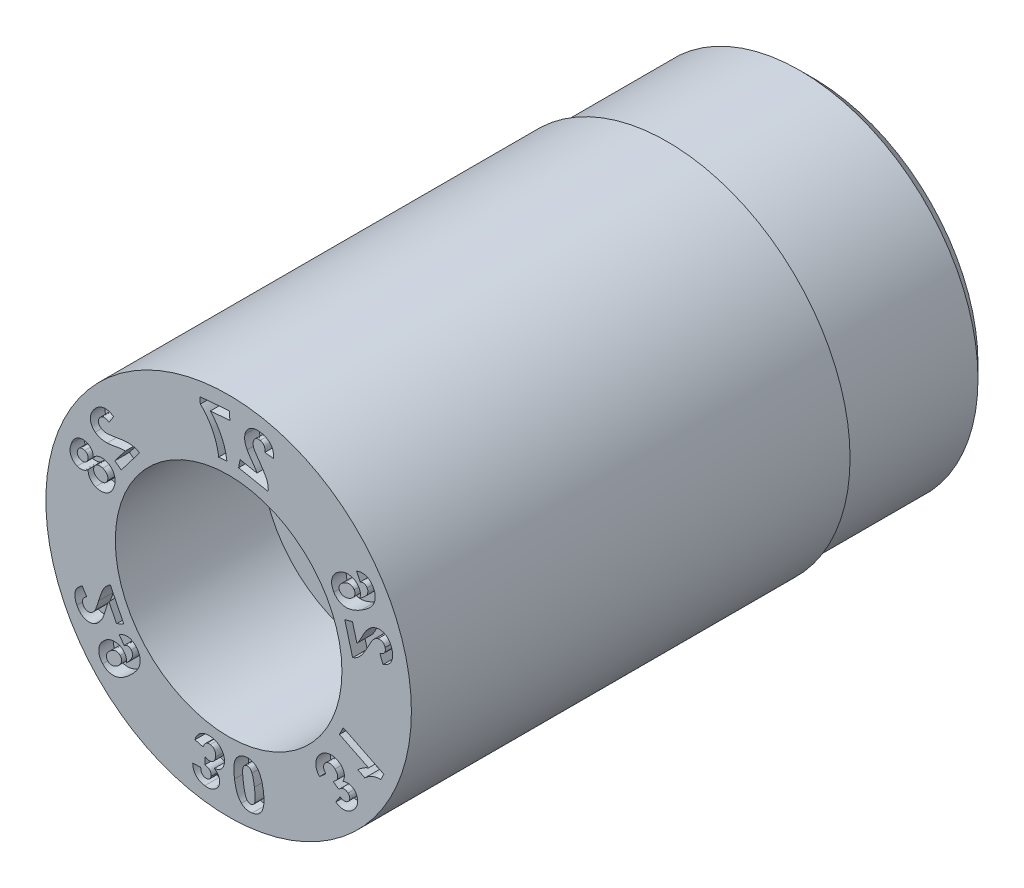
from build123d import *

# Parameters (mm, degrees)
SKETCH4_W          = 2
SKETCH4_H          = 1
CUT_EXTRUDE1_DEPTH = 0.2


with BuildPart() as part:
    # Sketch1 → Revolve1 (revolve)
    with BuildSketch(Plane(origin=(0, 0, 0), x_dir=(0, 0, -1), z_dir=(1, 0, 0)), mode=Mode.PRIVATE) as revolve1_sk:
        Polygon((0, 2.5), (0, 1.55), (2, 1.55), (2, 0.8), (8, 0.8), (8, 2.25), (7.75, 2.5), align=None)
    revolve(revolve1_sk.sketch.rotate(Axis((0, 0, 3.797909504), (0, 0, -1)), 90), axis=Axis((0, 0, 3.797909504), (0, 0, -1)))

    # Sketch4 → Cut-Revolve1 (revolve, cut)
    with BuildSketch(Plane(origin=(0, 0, 0), x_dir=(0, 0, -1), z_dir=(1, 0, 0)), mode=Mode.PRIVATE) as cut_revolve1_sk:
        with Locations((7, 2.935)):
            Rectangle(SKETCH4_W, SKETCH4_H)
    revolve(cut_revolve1_sk.sketch.rotate(Axis((0, 0, 0), (0, 0, -1)), 90), axis=Axis((0, 0, 0), (0, 0, -1)), mode=Mode.SUBTRACT)

    # Sketch6 → Cut-Extrude1 (cut)
    # profile 1 of 12: a face of its own
    with BuildSketch(Plane.XY):
        with BuildLine():
            Line((1.693950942, 0.65999395), (1.588626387, 0.631567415))
            Line((1.588626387, 0.631567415), (1.696082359, 0.234080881))
            add(Edge.make_bspline(
                [(1.696082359, 0.234080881), (1.705576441, 0.238145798), (1.724517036, 0.246255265), (1.751199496, 0.262189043), (1.776044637, 0.281268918), (1.79564423, 0.299575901), (1.810788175, 0.316646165), (1.822859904, 0.331763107), (1.835374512, 0.349202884), (1.848522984, 0.368822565), (1.862282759, 0.390654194), (1.87652278, 0.414800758), (1.891280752, 0.441235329), (1.901114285, 0.459713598), (1.90620458, 0.469278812)],
                knots=[0, 0, 0, 0, 1.150084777, 2.29440738, 3.452176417, 4.636326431, 5.276882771, 5.994082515, 6.791446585, 7.668481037, 8.626072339, 9.667142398, 10.79240413, 12, 12, 12, 12], degree=3))
            add(Edge.make_bspline(
                [(1.90620458, 0.469278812), (1.910213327, 0.476918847), (1.91785425, 0.49148123), (1.929262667, 0.512021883), (1.939579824, 0.53042489), (1.949071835, 0.546545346), (1.957348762, 0.560533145), (1.964942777, 0.572120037), (1.971384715, 0.581650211), (1.975745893, 0.587003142), (1.977684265, 0.589382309)],
                knots=[0, 0, 0, 0, 1.479662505, 2.820329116, 4.029559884, 5.09783273, 6.028857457, 6.816343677, 7.473911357, 8, 8, 8, 8], degree=3))
            add(Edge.make_bspline(
                [(1.977684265, 0.589382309), (1.982436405, 0.594539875), (1.99164, 0.604528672), (2.007316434, 0.616554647), (2.023514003, 0.626023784), (2.035031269, 0.62982165), (2.040714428, 0.631695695)],
                knots=[0, 0, 0, 0, 1.091492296, 2.113922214, 3.069320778, 4, 4, 4, 4], degree=3))
            add(Edge.make_bspline(
                [(2.040714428, 0.631695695), (2.046746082, 0.633098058), (2.058221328, 0.635766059), (2.07526479, 0.636205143), (2.090849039, 0.633542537), (2.104817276, 0.627499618), (2.116964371, 0.618603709), (2.127098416, 0.606898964), (2.135075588, 0.592588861), (2.138483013, 0.581859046), (2.140258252, 0.576268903)],
                knots=[0, 0, 0, 0, 1.147270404, 2.182686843, 3.142211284, 4.059915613, 4.982338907, 5.913874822, 6.913146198, 8, 8, 8, 8], degree=3))
            add(Edge.make_bspline(
                [(2.140258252, 0.576268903), (2.14153206, 0.570541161), (2.143972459, 0.559567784), (2.14399916, 0.54308768), (2.140868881, 0.527714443), (2.135441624, 0.515970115), (2.129704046, 0.507149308), (2.124055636, 0.500976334), (2.117564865, 0.494965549), (2.109923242, 0.489457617), (2.101323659, 0.48418464), (2.091750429, 0.479170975), (2.081074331, 0.474608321), (2.073557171, 0.471885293), (2.069646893, 0.470468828)],
                knots=[0, 0, 0, 0, 1.468341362, 2.813091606, 4.099813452, 5.373393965, 6.032874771, 6.732350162, 7.465620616, 8.248880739, 9.090286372, 9.994697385, 10.956881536, 12, 12, 12, 12], degree=3))
            Line((2.069646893, 0.470468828), (2.111498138, 0.360602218))
            add(Edge.make_bspline(
                [(2.111498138, 0.360602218), (2.118810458, 0.363567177), (2.132963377, 0.369305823), (2.152736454, 0.379529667), (2.170474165, 0.390686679), (2.186253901, 0.402694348), (2.200067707, 0.41559302), (2.211810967, 0.429456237), (2.221410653, 0.444339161), (2.22899259, 0.4600743), (2.234790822, 0.47644599), (2.239175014, 0.493316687), (2.241973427, 0.510682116), (2.243448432, 0.528543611), (2.243236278, 0.54687803), (2.241487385, 0.565684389), (2.238333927, 0.584980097), (2.23514593, 0.59786534), (2.233522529, 0.6044268)],
                knots=[0, 0, 0, 0, 1.240724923, 2.401410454, 3.496188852, 4.533356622, 5.515950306, 6.463496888, 7.383842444, 8.294179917, 9.204727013, 10.111914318, 11.032467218, 11.968258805, 12.927880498, 13.91262994, 14.93706367, 16, 16, 16, 16], degree=3))
            add(Edge.make_bspline(
                [(2.233522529, 0.6044268), (2.231456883, 0.61148499), (2.227425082, 0.625261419), (2.21970935, 0.644856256), (2.211005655, 0.662950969), (2.200989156, 0.679457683), (2.189741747, 0.694331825), (2.177386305, 0.707660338), (2.16388019, 0.719432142), (2.149264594, 0.729429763), (2.134050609, 0.737981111), (2.118286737, 0.744542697), (2.102297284, 0.749551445), (2.085968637, 0.752743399), (2.069382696, 0.754248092), (2.052492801, 0.753744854), (2.035271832, 0.751729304), (2.023865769, 0.748974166), (2.018070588, 0.747574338)],
                knots=[0, 0, 0, 0, 1.214021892, 2.369571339, 3.473396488, 4.526508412, 5.552641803, 6.547855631, 7.522974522, 8.504781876, 9.467453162, 10.400033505, 11.319412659, 12.230158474, 13.142596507, 14.063677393, 15.016194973, 16, 16, 16, 16], degree=3))
            add(Edge.make_bspline(
                [(2.018070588, 0.747574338), (2.01151342, 0.745642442), (1.998507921, 0.741810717), (1.979934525, 0.733721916), (1.962221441, 0.724236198), (1.945475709, 0.712767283), (1.929190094, 0.699564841), (1.913462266, 0.683973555), (1.897575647, 0.666481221), (1.887642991, 0.653584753), (1.882513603, 0.646924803)],
                knots=[0, 0, 0, 0, 0.951532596, 1.887271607, 2.816320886, 3.747087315, 4.710502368, 5.733080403, 6.829325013, 8, 8, 8, 8], degree=3))
            add(Edge.make_bspline(
                [(1.882513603, 0.646924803), (1.880714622, 0.644407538), (1.876880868, 0.63904307), (1.871029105, 0.630299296), (1.864782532, 0.620310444), (1.858093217, 0.609084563), (1.851040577, 0.596559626), (1.843300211, 0.582958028), (1.835303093, 0.568036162), (1.827154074, 0.552320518), (1.818966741, 0.536808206), (1.811364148, 0.522337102), (1.804466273, 0.509349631), (1.798288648, 0.497861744), (1.792751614, 0.4878764), (1.78791426, 0.479425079), (1.783712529, 0.472522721), (1.777379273, 0.462435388), (1.768351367, 0.449555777), (1.759169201, 0.439598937), (1.754789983, 0.434850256)],
                knots=[0, 0, 0, 0, 0.673245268, 1.43473287, 2.288992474, 3.236619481, 4.27804917, 5.416749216, 6.641964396, 7.961668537, 9.268953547, 10.458783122, 11.51875054, 12.46894333, 13.297057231, 14.003249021, 14.587773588, 15.055184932, 16.595539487, 18, 18, 18, 18], degree=3))
            Line((1.754789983, 0.434850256), (1.693950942, 0.65999395))
        make_face()
    # profile 2 of 12: a face of its own
    with BuildSketch(Plane.XY):
        with BuildLine():
            Line((1.7512136, 1.287458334), (1.79961903, 1.182801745))
            add(Edge.make_bspline(
                [(1.79961903, 1.182801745), (1.804795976, 1.184974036), (1.814556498, 1.189069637), (1.829323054, 1.192370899), (1.842990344, 1.193320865), (1.855599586, 1.191360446), (1.867125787, 1.187053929), (1.877330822, 1.180198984), (1.88662547, 1.171380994), (1.891358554, 1.164073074), (1.893812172, 1.160284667)],
                knots=[0, 0, 0, 0, 1.247434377, 2.351890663, 3.35226032, 4.278998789, 5.170524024, 6.068219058, 6.998569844, 8, 8, 8, 8], degree=3))
            add(Edge.make_bspline(
                [(1.893812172, 1.160284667), (1.8952968, 1.157597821), (1.898216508, 1.152313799), (1.901399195, 1.143879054), (1.903670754, 1.135272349), (1.904550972, 1.126339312), (1.904536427, 1.11719023), (1.903324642, 1.107808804), (1.901054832, 1.098225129), (1.897683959, 1.088260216), (1.892600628, 1.077808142), (1.885055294, 1.066978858), (1.875549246, 1.055354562), (1.863564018, 1.043223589), (1.84958869, 1.030275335), (1.833133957, 1.016838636), (1.81457006, 1.002606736), (1.801189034, 0.993203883), (1.794219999, 0.988306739)],
                knots=[0, 0, 0, 0, 0.668564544, 1.314816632, 1.960311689, 2.603783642, 3.265979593, 3.951693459, 4.661122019, 5.410600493, 6.241548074, 7.18561793, 8.281489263, 9.512806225, 10.900360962, 12.434301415, 14.142931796, 16, 16, 16, 16], degree=3))
            add(Edge.make_bspline(
                [(1.794219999, 0.988306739), (1.795868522, 0.99364896), (1.799093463, 1.004099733), (1.801929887, 1.020007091), (1.803203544, 1.0356328), (1.802648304, 1.051060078), (1.800169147, 1.066164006), (1.79608612, 1.080984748), (1.790298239, 1.095570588), (1.785044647, 1.104759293), (1.782374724, 1.109429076)],
                knots=[0, 0, 0, 0, 1.0649871, 2.083391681, 3.073103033, 4.049124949, 5.018326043, 5.984211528, 6.975557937, 8, 8, 8, 8], degree=3))
            add(Edge.make_bspline(
                [(1.782374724, 1.109429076), (1.779132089, 1.114576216), (1.772738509, 1.124724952), (1.761174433, 1.138329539), (1.748732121, 1.150723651), (1.734851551, 1.161348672), (1.719987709, 1.170692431), (1.703908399, 1.178518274), (1.68659593, 1.184621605), (1.668410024, 1.18937282), (1.649636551, 1.192559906), (1.630622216, 1.193573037), (1.61159103, 1.19271745), (1.592505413, 1.19006883), (1.573445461, 1.185063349), (1.554279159, 1.178511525), (1.53513631, 1.1698499), (1.522789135, 1.162759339), (1.516483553, 1.159138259)],
                knots=[0, 0, 0, 0, 0.965865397, 1.904419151, 2.83101484, 3.752807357, 4.676477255, 5.618117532, 6.588813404, 7.58964753, 8.603123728, 9.61016972, 10.610159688, 11.627666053, 12.666631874, 13.7375569, 14.844592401, 16, 16, 16, 16], degree=3))
            add(Edge.make_bspline(
                [(1.516483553, 1.159138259), (1.509954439, 1.155032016), (1.497194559, 1.147007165), (1.479705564, 1.133321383), (1.46395059, 1.118966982), (1.450278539, 1.103488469), (1.438340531, 1.08732773), (1.428576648, 1.070063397), (1.420520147, 1.052047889), (1.414493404, 1.033237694), (1.41050539, 1.014035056), (1.408454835, 0.994760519), (1.408460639, 0.975545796), (1.410408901, 0.956388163), (1.414671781, 0.937355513), (1.420892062, 0.918415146), (1.429049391, 0.899499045), (1.435925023, 0.887361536), (1.439430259, 0.881173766)],
                knots=[0, 0, 0, 0, 1.14050135, 2.228887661, 3.280812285, 4.289549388, 5.279666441, 6.247943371, 7.218078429, 8.194919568, 9.164184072, 10.115081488, 11.057656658, 12.002219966, 12.958272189, 13.937280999, 14.948414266, 16, 16, 16, 16], degree=3))
            add(Edge.make_bspline(
                [(1.439430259, 0.881173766), (1.443528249, 0.87474975), (1.451594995, 0.862104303), (1.465951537, 0.845129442), (1.481597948, 0.830124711), (1.498691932, 0.817239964), (1.517216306, 0.8064421), (1.537167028, 0.797726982), (1.558539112, 0.791134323), (1.58128493, 0.78651459), (1.605583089, 0.784499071), (1.631345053, 0.785819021), (1.658584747, 0.790175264), (1.687254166, 0.797758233), (1.717494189, 0.808288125), (1.749128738, 0.822022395), (1.782396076, 0.838627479), (1.804534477, 0.851639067), (1.816023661, 0.8583917)],
                knots=[0, 0, 0, 0, 0.857416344, 1.687793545, 2.496738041, 3.294750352, 4.092762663, 4.906356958, 5.741316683, 6.607311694, 7.515906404, 8.479534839, 9.505358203, 10.617588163, 11.815210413, 13.10852274, 14.499407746, 16, 16, 16, 16], degree=3))
            add(Edge.make_bspline(
                [(1.816023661, 0.8583917), (1.827634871, 0.865600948), (1.85002297, 0.879501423), (1.881073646, 0.901699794), (1.908728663, 0.923869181), (1.932834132, 0.946244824), (1.95326077, 0.96892432), (1.970213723, 0.991701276), (1.983873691, 1.014570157), (1.993495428, 1.037859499), (2.000303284, 1.060936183), (2.004209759, 1.083935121), (2.005749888, 1.106673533), (2.004728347, 1.129244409), (2.000768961, 1.151554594), (1.994193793, 1.173615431), (1.985236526, 1.195587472), (1.977347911, 1.20955268), (1.973323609, 1.216676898)],
                knots=[0, 0, 0, 0, 1.480599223, 2.854810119, 4.132995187, 5.318965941, 6.414568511, 7.435350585, 8.391695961, 9.292498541, 10.158192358, 10.993735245, 11.814957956, 12.623524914, 13.435581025, 14.26352703, 15.114154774, 16, 16, 16, 16], degree=3))
            add(Edge.make_bspline(
                [(1.973323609, 1.216676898), (1.970266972, 1.221521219), (1.964263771, 1.231035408), (1.954215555, 1.244248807), (1.94347721, 1.256176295), (1.932029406, 1.266795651), (1.919868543, 1.27601428), (1.907134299, 1.284116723), (1.893667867, 1.290766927), (1.879635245, 1.296274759), (1.865066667, 1.300344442), (1.850011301, 1.302923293), (1.834522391, 1.304055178), (1.818598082, 1.303748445), (1.802234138, 1.301982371), (1.78553982, 1.298455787), (1.768352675, 1.29384599), (1.757009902, 1.28961859), (1.7512136, 1.287458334)],
                knots=[0, 0, 0, 0, 1.070175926, 2.101812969, 3.098022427, 4.066440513, 5.015374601, 5.946475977, 6.882994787, 7.817785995, 8.760262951, 9.704738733, 10.667918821, 11.658432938, 12.677810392, 13.738856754, 14.844526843, 16, 16, 16, 16], degree=3))
        make_face()
        with BuildLine():
            add(Edge.make_bspline(
                [(1.668693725, 0.924396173), (1.664648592, 0.922052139), (1.656783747, 0.917494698), (1.644819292, 0.911690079), (1.633130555, 0.907036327), (1.621666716, 0.903667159), (1.610550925, 0.90111826), (1.599612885, 0.900088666), (1.588979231, 0.899817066), (1.578726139, 0.901011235), (1.568956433, 0.90285208), (1.559936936, 0.905818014), (1.551466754, 0.908963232), (1.54389075, 0.913261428), (1.536814, 0.917968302), (1.530755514, 0.923748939), (1.525063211, 0.929873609), (1.522097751, 0.934583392), (1.520594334, 0.936971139)],
                knots=[0, 0, 0, 0, 1.355907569, 2.636255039, 3.854249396, 5.000748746, 6.10023815, 7.15616267, 8.182719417, 9.17962204, 10.144766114, 11.061075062, 11.931116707, 12.759893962, 13.582206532, 14.389114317, 15.183319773, 16, 16, 16, 16], degree=3))
            add(Edge.make_bspline(
                [(1.520594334, 0.936971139), (1.51809673, 0.941633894), (1.513203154, 0.950769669), (1.510024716, 0.96604637), (1.510088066, 0.981696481), (1.513175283, 0.994813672), (1.517354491, 1.005388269), (1.522101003, 1.013255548), (1.527844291, 1.021183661), (1.534853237, 1.02898774), (1.543106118, 1.036798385), (1.552669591, 1.044400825), (1.563374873, 1.052064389), (1.571064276, 1.056859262), (1.575060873, 1.059351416)],
                knots=[0, 0, 0, 0, 1.254304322, 2.457568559, 3.670491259, 4.957396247, 5.64128616, 6.371587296, 7.138580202, 7.970872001, 8.865820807, 9.842093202, 10.878419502, 12, 12, 12, 12], degree=3))
            add(Edge.make_bspline(
                [(1.575060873, 1.059351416), (1.579257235, 1.061801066), (1.587373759, 1.066539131), (1.599597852, 1.072601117), (1.6113259, 1.077484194), (1.622532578, 1.081392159), (1.633279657, 1.083972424), (1.643589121, 1.085388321), (1.653398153, 1.085682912), (1.662737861, 1.08485161), (1.671498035, 1.083018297), (1.679708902, 1.080359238), (1.687383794, 1.076987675), (1.694616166, 1.072977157), (1.70109495, 1.067883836), (1.707085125, 1.062200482), (1.712552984, 1.05575303), (1.71562672, 1.050976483), (1.717201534, 1.048529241)],
                knots=[0, 0, 0, 0, 1.451549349, 2.807559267, 4.073039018, 5.24563403, 6.349951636, 7.369471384, 8.349895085, 9.275736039, 10.164388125, 11.018535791, 11.849621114, 12.666406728, 13.481879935, 14.30426643, 15.131198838, 16, 16, 16, 16], degree=3))
            add(Edge.make_bspline(
                [(1.717201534, 1.048529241), (1.719791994, 1.043681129), (1.72488401, 1.034151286), (1.728267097, 1.018163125), (1.728312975, 1.001660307), (1.72510018, 0.987810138), (1.721003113, 0.976742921), (1.716607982, 0.96859379), (1.711247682, 0.960659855), (1.704866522, 0.952873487), (1.697320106, 0.945376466), (1.688776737, 0.938077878), (1.679219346, 0.930953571), (1.672282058, 0.926631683), (1.668693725, 0.924396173)],
                knots=[0, 0, 0, 0, 1.316511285, 2.587841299, 3.884198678, 5.258967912, 5.981555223, 6.718479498, 7.47950212, 8.28219161, 9.135891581, 10.034636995, 10.983409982, 12, 12, 12, 12], degree=3))
        make_face(mode=Mode.SUBTRACT)
    # profile 3 of 12: a face of its own
    with BuildSketch(Plane.XY):
        with BuildLine():
            Line((0.157476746, 1.811937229), (0.136252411, 1.704527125))
            Line((0.136252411, 1.704527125), (0.541370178, 1.624316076))
            add(Edge.make_bspline(
                [(0.541370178, 1.624316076), (0.541970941, 1.634646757), (0.543171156, 1.655285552), (0.540332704, 1.686317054), (0.534607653, 1.717207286), (0.526709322, 1.742924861), (0.518153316, 1.764132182), (0.510039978, 1.781748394), (0.499875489, 1.800731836), (0.488019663, 1.821255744), (0.474470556, 1.843331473), (0.459182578, 1.866949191), (0.441893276, 1.891928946), (0.429657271, 1.909001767), (0.423327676, 1.917833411)],
                knots=[0, 0, 0, 0, 1.148368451, 2.294228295, 3.451452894, 4.634714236, 5.275557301, 5.991609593, 6.788471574, 7.667164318, 8.624930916, 9.666149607, 10.792716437, 12, 12, 12, 12], degree=3))
            add(Edge.make_bspline(
                [(0.423327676, 1.917833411), (0.418273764, 1.92485282), (0.408616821, 1.938265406), (0.395114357, 1.957594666), (0.383213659, 1.975122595), (0.372831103, 1.990726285), (0.364095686, 2.004533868), (0.356898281, 2.016430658), (0.351211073, 2.026495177), (0.348321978, 2.032769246), (0.347034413, 2.035565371)],
                knots=[0, 0, 0, 0, 1.477945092, 2.824036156, 4.028698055, 5.098021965, 6.026444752, 6.820154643, 7.474185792, 8, 8, 8, 8], degree=3))
            add(Edge.make_bspline(
                [(0.347034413, 2.035565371), (0.344552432, 2.042132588), (0.339757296, 2.054820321), (0.33582838, 2.074171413), (0.334655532, 2.092898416), (0.336383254, 2.10492088), (0.337236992, 2.110861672)],
                knots=[0, 0, 0, 0, 1.09271195, 2.111097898, 3.066616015, 4, 4, 4, 4], degree=3))
            add(Edge.make_bspline(
                [(0.337236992, 2.110861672), (0.338685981, 2.116914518), (0.341439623, 2.128417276), (0.348544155, 2.143979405), (0.357944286, 2.156759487), (0.369506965, 2.166667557), (0.382918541, 2.173580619), (0.397881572, 2.177604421), (0.414333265, 2.178241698), (0.425494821, 2.176534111), (0.431321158, 2.17564275)],
                knots=[0, 0, 0, 0, 1.15006033, 2.18556128, 3.142707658, 4.064604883, 4.978055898, 5.91295048, 6.910559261, 8, 8, 8, 8], degree=3))
            add(Edge.make_bspline(
                [(0.431321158, 2.17564275), (0.437007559, 2.174273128), (0.447952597, 2.171636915), (0.462708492, 2.164298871), (0.475215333, 2.154749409), (0.483489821, 2.144672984), (0.488571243, 2.1354272), (0.491833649, 2.127716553), (0.494175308, 2.119166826), (0.495907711, 2.109865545), (0.496650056, 2.099768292), (0.496982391, 2.088898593), (0.496268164, 2.077249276), (0.49534942, 2.06926041), (0.494876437, 2.065147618)],
                knots=[0, 0, 0, 0, 1.459090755, 2.808420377, 4.087128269, 5.370523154, 6.033545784, 6.721800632, 7.459239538, 8.246262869, 9.084479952, 9.988662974, 10.964532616, 12, 12, 12, 12], degree=3))
            Line((0.494876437, 2.065147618), (0.612358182, 2.053753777))
            add(Edge.make_bspline(
                [(0.612358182, 2.053753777), (0.612887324, 2.061634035), (0.613914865, 2.076936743), (0.61351589, 2.099274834), (0.611544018, 2.120225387), (0.607746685, 2.139778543), (0.602041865, 2.157856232), (0.594955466, 2.174660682), (0.585960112, 2.190009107), (0.575145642, 2.203808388), (0.562946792, 2.21627516), (0.549776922, 2.227787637), (0.535427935, 2.238075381), (0.520006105, 2.24723174), (0.503468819, 2.255199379), (0.485796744, 2.262005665), (0.467042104, 2.267690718), (0.454065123, 2.270534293), (0.447468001, 2.271979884)],
                knots=[0, 0, 0, 0, 1.238138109, 2.404346, 3.499268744, 4.53465455, 5.521366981, 6.467116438, 7.389056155, 8.302244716, 9.209319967, 10.120891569, 11.042099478, 11.974043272, 12.930209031, 13.917241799, 14.941185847, 16, 16, 16, 16], degree=3))
            add(Edge.make_bspline(
                [(0.447468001, 2.271979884), (0.440192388, 2.273303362), (0.42599571, 2.275885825), (0.404943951, 2.277613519), (0.384804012, 2.277656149), (0.36554971, 2.276049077), (0.347166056, 2.272668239), (0.329648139, 2.26764473), (0.313139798, 2.260549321), (0.297554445, 2.251973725), (0.283185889, 2.241935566), (0.270081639, 2.230906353), (0.258607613, 2.218642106), (0.248449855, 2.205464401), (0.239763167, 2.191156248), (0.232516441, 2.175815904), (0.226877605, 2.159370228), (0.224271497, 2.147951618), (0.222948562, 2.142155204)],
                knots=[0, 0, 0, 0, 1.217302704, 2.375285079, 3.473028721, 4.531161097, 5.552451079, 6.546990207, 7.525697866, 8.505331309, 9.471730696, 10.40790542, 11.320850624, 12.232190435, 13.14350474, 14.072000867, 15.021292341, 16, 16, 16, 16], degree=3))
            add(Edge.make_bspline(
                [(0.222948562, 2.142155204), (0.221771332, 2.135392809), (0.219443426, 2.122020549), (0.21845782, 2.101715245), (0.219078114, 2.081571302), (0.22194419, 2.061395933), (0.22648992, 2.040866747), (0.233574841, 2.019799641), (0.242066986, 1.997629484), (0.249346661, 1.982982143), (0.253105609, 1.975418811)],
                knots=[0, 0, 0, 0, 0.952031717, 1.882589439, 2.81624764, 3.745793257, 4.707197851, 5.730766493, 6.828253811, 8, 8, 8, 8], degree=3))
            add(Edge.make_bspline(
                [(0.253105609, 1.975418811), (0.25454656, 1.972654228), (0.257599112, 1.966797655), (0.26306203, 1.957745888), (0.269092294, 1.947610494), (0.276274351, 1.936602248), (0.284259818, 1.924631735), (0.293383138, 1.911799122), (0.303085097, 1.897853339), (0.313625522, 1.883514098), (0.324042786, 1.869369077), (0.333562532, 1.855993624), (0.342259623, 1.844053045), (0.349742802, 1.833295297), (0.356312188, 1.82394522), (0.361653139, 1.815775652), (0.366188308, 1.809036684), (0.372337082, 1.798817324), (0.379834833, 1.785061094), (0.384726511, 1.772502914), (0.387055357, 1.766524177)],
                knots=[0, 0, 0, 0, 0.676649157, 1.433432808, 2.294471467, 3.236938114, 4.28638453, 5.418264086, 6.654914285, 7.974423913, 9.28157065, 10.468627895, 11.538504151, 12.488398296, 13.313555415, 14.019018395, 14.607352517, 15.076524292, 16.608182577, 18, 18, 18, 18], degree=3))
            Line((0.387055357, 1.766524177), (0.157476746, 1.811937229))
        make_face()
    # profile 4 of 12: a face of its own
    with BuildSketch(Plane.XY):
        with BuildLine():
            Line((0.017561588, 2.205994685), (0.008437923, 2.315419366))
            Line((0.008437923, 2.315419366), (-0.394350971, 2.281786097))
            Line((-0.394350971, 2.281786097), (-0.387251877, 2.196328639))
            add(Edge.make_bspline(
                [(-0.387251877, 2.196328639), (-0.382678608, 2.192392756), (-0.373303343, 2.184324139), (-0.359620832, 2.171022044), (-0.34570835, 2.156473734), (-0.331573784, 2.140600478), (-0.317333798, 2.12333145), (-0.303040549, 2.104683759), (-0.288459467, 2.084810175), (-0.268736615, 2.056615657), (-0.245342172, 2.019595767), (-0.220080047, 1.973206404), (-0.197882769, 1.925093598), (-0.181899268, 1.883899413), (-0.170591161, 1.850728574), (-0.163066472, 1.826376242), (-0.156605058, 1.802587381), (-0.150732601, 1.779525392), (-0.145923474, 1.757017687), (-0.142133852, 1.735097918), (-0.139103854, 1.713800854), (-0.137789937, 1.699766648), (-0.137143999, 1.692867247)],
                knots=[0, 0, 0, 0, 0.630395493, 1.29231949, 1.993071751, 2.733675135, 3.512825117, 4.331496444, 5.188588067, 6.088449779, 7.926757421, 9.761421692, 11.604330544, 13.459910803, 14.375974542, 15.26621738, 16.122861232, 16.951711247, 17.752807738, 18.527211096, 19.275957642, 20, 20, 20, 20], degree=3))
            Line((-0.137143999, 1.692867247), (-0.02361584, 1.70230472))
            add(Edge.make_bspline(
                [(-0.02361584, 1.70230472), (-0.024876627, 1.712921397), (-0.027411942, 1.734270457), (-0.033168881, 1.766125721), (-0.040140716, 1.798065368), (-0.048681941, 1.82999542), (-0.058800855, 1.861972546), (-0.070189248, 1.894021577), (-0.083207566, 1.926061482), (-0.097624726, 1.957940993), (-0.113202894, 1.98943532), (-0.129828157, 2.020122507), (-0.147417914, 2.049878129), (-0.166169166, 2.078478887), (-0.185539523, 2.106359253), (-0.206120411, 2.13308621), (-0.227514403, 2.159008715), (-0.242665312, 2.175453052), (-0.250222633, 2.18365554)],
                knots=[0, 0, 0, 0, 0.948579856, 1.907497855, 2.871245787, 3.849154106, 4.839461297, 5.846969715, 6.866709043, 7.907534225, 8.951260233, 9.984124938, 11.004128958, 12.017681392, 13.018475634, 14.016054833, 15.010401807, 16, 16, 16, 16], degree=3))
            Line((-0.250222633, 2.18365554), (0.017561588, 2.205994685))
        make_face()
    # profile 5 of 12: a face of its own
    with BuildSketch(Plane.XY):
        with BuildLine():
            Line((-1.556225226, 0.940884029), (-1.469122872, 0.874364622))
            Line((-1.469122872, 0.874364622), (-1.217944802, 1.203271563))
            add(Edge.make_bspline(
                [(-1.217944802, 1.203271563), (-1.22697459, 1.208387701), (-1.245019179, 1.218611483), (-1.274144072, 1.229935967), (-1.304539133, 1.238264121), (-1.331129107, 1.242565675), (-1.353980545, 1.244444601), (-1.373422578, 1.244490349), (-1.39499257, 1.24412975), (-1.418705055, 1.242410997), (-1.444530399, 1.240105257), (-1.472461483, 1.23643702), (-1.502605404, 1.232380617), (-1.523352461, 1.228835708), (-1.534101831, 1.226999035)],
                knots=[0, 0, 0, 0, 1.149354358, 2.296800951, 3.453144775, 4.638287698, 5.277076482, 5.993274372, 6.792543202, 7.668374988, 8.628200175, 9.666750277, 10.791107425, 12, 12, 12, 12], degree=3))
            add(Edge.make_bspline(
                [(-1.534101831, 1.226999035), (-1.542676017, 1.225548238), (-1.559012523, 1.222784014), (-1.582344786, 1.219105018), (-1.603327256, 1.216166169), (-1.621911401, 1.213531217), (-1.638217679, 1.21190049), (-1.652140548, 1.210540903), (-1.663729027, 1.210058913), (-1.670648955, 1.21017978), (-1.673702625, 1.210233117)],
                knots=[0, 0, 0, 0, 1.482543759, 2.824709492, 4.026680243, 5.094745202, 6.024175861, 6.820226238, 7.479381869, 8, 8, 8, 8], degree=3))
            add(Edge.make_bspline(
                [(-1.673702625, 1.210233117), (-1.680710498, 1.21094123), (-1.694220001, 1.212306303), (-1.713470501, 1.217247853), (-1.730888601, 1.224514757), (-1.740984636, 1.23145636), (-1.74592254, 1.234851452)],
                knots=[0, 0, 0, 0, 1.091248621, 2.103666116, 3.072515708, 4, 4, 4, 4], degree=3))
            add(Edge.make_bspline(
                [(-1.74592254, 1.234851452), (-1.750711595, 1.238792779), (-1.759833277, 1.2462998), (-1.770538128, 1.259602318), (-1.777958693, 1.273660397), (-1.781658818, 1.288447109), (-1.782189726, 1.303579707), (-1.778901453, 1.318704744), (-1.772557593, 1.333900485), (-1.765999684, 1.343129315), (-1.762558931, 1.347971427)],
                knots=[0, 0, 0, 0, 1.144860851, 2.180609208, 3.135884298, 4.062646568, 4.976504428, 5.911488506, 6.90421587, 8, 8, 8, 8], degree=3))
            add(Edge.make_bspline(
                [(-1.762558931, 1.347971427), (-1.758802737, 1.352495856), (-1.751576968, 1.361199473), (-1.738482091, 1.371364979), (-1.724217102, 1.378132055), (-1.711581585, 1.3812139), (-1.701015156, 1.381838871), (-1.69264251, 1.381276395), (-1.683877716, 1.379592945), (-1.674787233, 1.376857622), (-1.665314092, 1.373267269), (-1.655463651, 1.368613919), (-1.645241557, 1.362969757), (-1.638450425, 1.358581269), (-1.634955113, 1.356322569)],
                knots=[0, 0, 0, 0, 1.463013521, 2.81439029, 4.093969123, 5.374546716, 6.028419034, 6.726958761, 7.460973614, 8.248756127, 9.091111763, 9.984535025, 10.962664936, 12, 12, 12, 12], degree=3))
            Line((-1.634955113, 1.356322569), (-1.573026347, 1.456977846))
            add(Edge.make_bspline(
                [(-1.573026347, 1.456977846), (-1.579855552, 1.46096559), (-1.593105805, 1.468702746), (-1.613429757, 1.478109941), (-1.633147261, 1.485604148), (-1.652434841, 1.490691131), (-1.67113307, 1.493869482), (-1.689388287, 1.494745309), (-1.707152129, 1.493455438), (-1.724328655, 1.489844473), (-1.740967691, 1.484568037), (-1.756963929, 1.477492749), (-1.772666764, 1.469324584), (-1.787648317, 1.459353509), (-1.802260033, 1.448028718), (-1.816094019, 1.435037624), (-1.829695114, 1.420785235), (-1.837946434, 1.410309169), (-1.842171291, 1.404945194)],
                knots=[0, 0, 0, 0, 1.236541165, 2.399178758, 3.499154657, 4.532250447, 5.514754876, 6.461005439, 7.384439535, 8.293036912, 9.200594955, 10.110115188, 11.026160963, 11.966251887, 12.921305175, 13.91493233, 14.932399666, 16, 16, 16, 16], degree=3))
            add(Edge.make_bspline(
                [(-1.842171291, 1.404945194), (-1.846557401, 1.399000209), (-1.855135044, 1.387373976), (-1.865965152, 1.369195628), (-1.874957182, 1.351119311), (-1.881954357, 1.333066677), (-1.887028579, 1.315072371), (-1.890084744, 1.297069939), (-1.891111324, 1.279125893), (-1.890271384, 1.261316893), (-1.887567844, 1.244016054), (-1.883367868, 1.227388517), (-1.877441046, 1.211641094), (-1.870296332, 1.196548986), (-1.86098291, 1.182605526), (-1.85044053, 1.169323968), (-1.838303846, 1.15683298), (-1.829152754, 1.149479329), (-1.824512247, 1.145750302)],
                knots=[0, 0, 0, 0, 1.214440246, 2.375004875, 3.474797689, 4.531574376, 5.554489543, 6.544586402, 7.528577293, 8.504905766, 9.471115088, 10.404027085, 11.320064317, 12.234810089, 13.143479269, 14.070608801, 15.021608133, 16, 16, 16, 16], degree=3))
            add(Edge.make_bspline(
                [(-1.824512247, 1.145750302), (-1.818926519, 1.141735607), (-1.807846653, 1.133772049), (-1.790088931, 1.123741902), (-1.771571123, 1.11562253), (-1.75223272, 1.109179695), (-1.731706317, 1.104325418), (-1.70968162, 1.101209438), (-1.686011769, 1.099114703), (-1.669680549, 1.099168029), (-1.661237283, 1.099195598)],
                knots=[0, 0, 0, 0, 0.952680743, 1.889739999, 2.819730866, 3.750517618, 4.710613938, 5.738117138, 6.830603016, 8, 8, 8, 8], degree=3))
            add(Edge.make_bspline(
                [(-1.661237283, 1.099195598), (-1.658135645, 1.099293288), (-1.651487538, 1.099502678), (-1.640909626, 1.100211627), (-1.629077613, 1.101419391), (-1.616012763, 1.10288584), (-1.601702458, 1.104908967), (-1.586151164, 1.107170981), (-1.569359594, 1.10999515), (-1.551813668, 1.11299367), (-1.534470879, 1.116174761), (-1.518262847, 1.118858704), (-1.503694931, 1.121336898), (-1.490760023, 1.123284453), (-1.479457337, 1.124958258), (-1.469781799, 1.126286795), (-1.461740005, 1.127400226), (-1.449806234, 1.12845523), (-1.434013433, 1.128966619), (-1.42044789, 1.127717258), (-1.41397638, 1.127121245)],
                knots=[0, 0, 0, 0, 0.671719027, 1.439774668, 2.294303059, 3.246157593, 4.285498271, 5.422662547, 6.647912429, 7.971262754, 9.27594048, 10.464625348, 11.527575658, 12.474693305, 13.296156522, 14.000900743, 14.588977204, 15.053092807, 16.594163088, 18, 18, 18, 18], degree=3))
            Line((-1.41397638, 1.127121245), (-1.556225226, 0.940884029))
        make_face()
    # profile 6 of 12: a face of its own
    with BuildSketch(Plane.XY):
        with BuildLine():
            add(Edge.make_bspline(
                [(-1.850754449, 0.835895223), (-1.851225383, 0.843806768), (-1.852128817, 0.858984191), (-1.857026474, 0.880588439), (-1.864592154, 0.900012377), (-1.875237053, 0.916992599), (-1.888016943, 0.931731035), (-1.902547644, 0.944404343), (-1.918825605, 0.954995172), (-1.930697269, 0.960212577), (-1.936710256, 0.962855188)],
                knots=[0, 0, 0, 0, 1.162899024, 2.230892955, 3.240378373, 4.211357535, 5.159859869, 6.097119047, 7.03619248, 8, 8, 8, 8], degree=3))
            add(Edge.make_bspline(
                [(-1.936710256, 0.962855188), (-1.941956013, 0.964763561), (-1.952257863, 0.968511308), (-1.968045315, 0.972220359), (-1.983661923, 0.974355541), (-1.999172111, 0.974737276), (-2.01451328, 0.973617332), (-2.029720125, 0.970709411), (-2.044779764, 0.966235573), (-2.059564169, 0.959951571), (-2.073919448, 0.952080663), (-2.087449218, 0.942402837), (-2.100182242, 0.93110754), (-2.112029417, 0.918097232), (-2.123135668, 0.903477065), (-2.13310353, 0.887009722), (-2.142615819, 0.869121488), (-2.147868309, 0.856283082), (-2.150567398, 0.849685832)],
                knots=[0, 0, 0, 0, 0.981716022, 1.927937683, 2.847786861, 3.751184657, 4.65352406, 5.549753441, 6.470727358, 7.413238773, 8.371751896, 9.346303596, 10.334487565, 11.36186435, 12.438494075, 13.56021042, 14.746269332, 16, 16, 16, 16], degree=3))
            add(Edge.make_bspline(
                [(-2.150567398, 0.849685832), (-2.153026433, 0.843041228), (-2.157799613, 0.830143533), (-2.163247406, 0.810753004), (-2.166769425, 0.791969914), (-2.168743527, 0.773800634), (-2.168960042, 0.756244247), (-2.167279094, 0.739306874), (-2.163892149, 0.722978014), (-2.158717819, 0.707375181), (-2.152174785, 0.69261), (-2.144231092, 0.678940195), (-2.135173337, 0.666328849), (-2.124726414, 0.654984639), (-2.113165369, 0.644660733), (-2.100202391, 0.635654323), (-2.086160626, 0.62752209), (-2.076022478, 0.623311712), (-2.070878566, 0.621175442)],
                knots=[0, 0, 0, 0, 1.247274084, 2.421056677, 3.541538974, 4.608797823, 5.635655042, 6.627311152, 7.600193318, 8.566003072, 9.516532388, 10.438942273, 11.345369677, 12.244999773, 13.14922586, 14.068866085, 15.020177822, 16, 16, 16, 16], degree=3))
            add(Edge.make_bspline(
                [(-2.070878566, 0.621175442), (-2.064357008, 0.618860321), (-2.051548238, 0.61431327), (-2.031583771, 0.611159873), (-2.011765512, 0.610842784), (-1.992192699, 0.613612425), (-1.973170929, 0.619230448), (-1.954973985, 0.627716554), (-1.937832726, 0.63913007), (-1.927656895, 0.648596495), (-1.922471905, 0.653420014)],
                knots=[0, 0, 0, 0, 1.028192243, 2.019437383, 2.992277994, 3.969091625, 4.949804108, 5.933879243, 6.947229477, 8, 8, 8, 8], degree=3))
            add(Edge.make_bspline(
                [(-1.922471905, 0.653420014), (-1.922371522, 0.648911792), (-1.922174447, 0.640061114), (-1.920824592, 0.62706309), (-1.918530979, 0.614607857), (-1.915802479, 0.602535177), (-1.911699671, 0.591109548), (-1.907275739, 0.57999448), (-1.901761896, 0.569472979), (-1.893291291, 0.556229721), (-1.881057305, 0.540872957), (-1.863394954, 0.525118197), (-1.843269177, 0.511711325), (-1.828316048, 0.505211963), (-1.82069062, 0.501897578)],
                knots=[0, 0, 0, 0, 0.832961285, 1.635294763, 2.410930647, 3.172559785, 3.91858759, 4.651041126, 5.381695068, 6.108977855, 7.554221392, 8.992464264, 10.466291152, 12, 12, 12, 12], degree=3))
            add(Edge.make_bspline(
                [(-1.82069062, 0.501897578), (-1.814233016, 0.499520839), (-1.801564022, 0.494857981), (-1.782215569, 0.490044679), (-1.763196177, 0.487078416), (-1.744463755, 0.48605485), (-1.726049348, 0.486943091), (-1.707922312, 0.489927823), (-1.690121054, 0.494831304), (-1.672707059, 0.50150005), (-1.656030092, 0.509965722), (-1.640358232, 0.520178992), (-1.625849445, 0.532112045), (-1.612549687, 0.545772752), (-1.600271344, 0.560945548), (-1.589263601, 0.577833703), (-1.579349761, 0.596310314), (-1.573834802, 0.609466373), (-1.571019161, 0.616183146)],
                knots=[0, 0, 0, 0, 1.067540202, 2.094377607, 3.089014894, 4.051747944, 5.001610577, 5.945169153, 6.897528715, 7.86326014, 8.835109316, 9.795264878, 10.761423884, 11.745037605, 12.750084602, 13.78655035, 14.869932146, 16, 16, 16, 16], degree=3))
            add(Edge.make_bspline(
                [(-1.571019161, 0.616183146), (-1.568629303, 0.622558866), (-1.563944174, 0.635057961), (-1.558765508, 0.65407734), (-1.555113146, 0.672741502), (-1.552961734, 0.691151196), (-1.552618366, 0.709225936), (-1.553649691, 0.72703573), (-1.556332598, 0.744523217), (-1.559428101, 0.755880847), (-1.560972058, 0.761545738)],
                knots=[0, 0, 0, 0, 1.099898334, 2.156263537, 3.181053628, 4.17127726, 5.147501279, 6.098712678, 7.05168717, 8, 8, 8, 8], degree=3))
            add(Edge.make_bspline(
                [(-1.560972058, 0.761545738), (-1.563121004, 0.76800173), (-1.567366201, 0.780755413), (-1.576465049, 0.798532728), (-1.587040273, 0.815105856), (-1.599856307, 0.829916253), (-1.614308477, 0.843442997), (-1.630749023, 0.855357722), (-1.648971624, 0.865955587), (-1.662175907, 0.871516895), (-1.668914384, 0.87435497)],
                knots=[0, 0, 0, 0, 1.007085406, 1.989476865, 2.950795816, 3.914305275, 4.88373545, 5.878427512, 6.917308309, 8, 8, 8, 8], degree=3))
            add(Edge.make_bspline(
                [(-1.668914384, 0.87435497), (-1.676618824, 0.877035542), (-1.691804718, 0.882319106), (-1.715463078, 0.886594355), (-1.7392308, 0.887409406), (-1.759045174, 0.885709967), (-1.774718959, 0.882493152), (-1.786317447, 0.878963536), (-1.797714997, 0.874452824), (-1.808781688, 0.868666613), (-1.81969534, 0.862062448), (-1.8304298, 0.854428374), (-1.840762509, 0.845587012), (-1.847389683, 0.839158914), (-1.850754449, 0.835895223)],
                knots=[0, 0, 0, 0, 1.482347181, 2.921791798, 4.35297719, 5.798379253, 6.527672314, 7.260069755, 8.001243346, 8.754072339, 9.528918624, 10.320601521, 11.147331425, 12, 12, 12, 12], degree=3))
        make_face()
        with BuildLine():
            add(Edge.make_bspline(
                [(-1.969433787, 0.856571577), (-1.964388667, 0.854350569), (-1.954713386, 0.850091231), (-1.942262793, 0.841095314), (-1.932423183, 0.830525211), (-1.925502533, 0.818366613), (-1.921367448, 0.805076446), (-1.920213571, 0.790991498), (-1.921893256, 0.776261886), (-1.925249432, 0.766742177), (-1.926996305, 0.761787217)],
                knots=[0, 0, 0, 0, 1.124873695, 2.157227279, 3.117032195, 4.057025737, 4.993810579, 5.940983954, 6.928292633, 8, 8, 8, 8], degree=3))
            add(Edge.make_bspline(
                [(-1.926996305, 0.761787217), (-1.929104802, 0.756921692), (-1.933174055, 0.747531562), (-1.94200355, 0.735456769), (-1.952598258, 0.725906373), (-1.96474072, 0.718930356), (-1.978201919, 0.714561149), (-1.992718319, 0.71339188), (-2.008018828, 0.715413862), (-2.018013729, 0.718888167), (-2.023235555, 0.720703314)],
                knots=[0, 0, 0, 0, 1.073553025, 2.071883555, 3.008227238, 3.948970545, 4.893121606, 5.856697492, 6.880233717, 8, 8, 8, 8], degree=3))
            add(Edge.make_bspline(
                [(-2.023235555, 0.720703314), (-2.028046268, 0.7228117), (-2.037294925, 0.726865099), (-2.049167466, 0.735722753), (-2.058657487, 0.746193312), (-2.065571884, 0.758295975), (-2.069743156, 0.771516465), (-2.071055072, 0.785541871), (-2.069316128, 0.800105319), (-2.066079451, 0.809580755), (-2.064406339, 0.814478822)],
                knots=[0, 0, 0, 0, 1.090310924, 2.096137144, 3.056494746, 4.01313392, 4.973993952, 5.920018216, 6.924810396, 8, 8, 8, 8], degree=3))
            add(Edge.make_bspline(
                [(-2.064406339, 0.814478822), (-2.062243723, 0.819409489), (-2.058099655, 0.828857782), (-2.049140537, 0.841001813), (-2.038668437, 0.850849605), (-2.026305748, 0.857642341), (-2.012980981, 0.862066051), (-1.998779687, 0.863133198), (-1.984003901, 0.861601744), (-1.97441885, 0.858292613), (-1.969433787, 0.856571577)],
                knots=[0, 0, 0, 0, 1.100708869, 2.109210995, 3.071290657, 4.024154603, 4.977925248, 5.927343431, 6.92203769, 8, 8, 8, 8], degree=3))
        make_face(mode=Mode.SUBTRACT)
        with BuildLine():
            add(Edge.make_bspline(
                [(-1.7217749, 0.77086009), (-1.718149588, 0.769376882), (-1.711064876, 0.766478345), (-1.701126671, 0.761289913), (-1.692119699, 0.755596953), (-1.683858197, 0.749609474), (-1.676710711, 0.742865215), (-1.670360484, 0.735782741), (-1.664781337, 0.728323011), (-1.659055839, 0.717689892), (-1.653780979, 0.703938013), (-1.651149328, 0.686748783), (-1.652331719, 0.669309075), (-1.656034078, 0.658247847), (-1.657926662, 0.652593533)],
                knots=[0, 0, 0, 0, 0.933514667, 1.824307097, 2.668319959, 3.472735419, 4.252490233, 5.005809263, 5.739473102, 6.4667351, 7.87925947, 9.228065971, 10.583033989, 12, 12, 12, 12], degree=3))
            add(Edge.make_bspline(
                [(-1.657926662, 0.652593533), (-1.660333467, 0.647278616), (-1.665024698, 0.63691903), (-1.67564718, 0.62366399), (-1.688879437, 0.613351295), (-1.701557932, 0.606971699), (-1.712693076, 0.60341055), (-1.72160017, 0.601707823), (-1.730908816, 0.600938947), (-1.740571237, 0.60113305), (-1.750634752, 0.602314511), (-1.761096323, 0.604393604), (-1.771932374, 0.607566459), (-1.779182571, 0.610241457), (-1.782906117, 0.611615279)],
                knots=[0, 0, 0, 0, 1.413811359, 2.755734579, 4.079085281, 5.463924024, 6.180253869, 6.914793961, 7.662650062, 8.446394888, 9.259366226, 10.122173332, 11.035588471, 12, 12, 12, 12], degree=3))
            add(Edge.make_bspline(
                [(-1.782906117, 0.611615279), (-1.78614414, 0.612972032), (-1.792468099, 0.615621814), (-1.801347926, 0.620356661), (-1.809520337, 0.625456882), (-1.816772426, 0.631293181), (-1.823471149, 0.637398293), (-1.829303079, 0.644175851), (-1.834184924, 0.651571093), (-1.839935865, 0.661675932), (-1.844752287, 0.675176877), (-1.847276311, 0.69198623), (-1.84580154, 0.709226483), (-1.842155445, 0.720241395), (-1.84028333, 0.725897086)],
                knots=[0, 0, 0, 0, 0.880393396, 1.719435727, 2.522136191, 3.293302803, 4.051559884, 4.793709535, 5.529434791, 6.271802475, 7.707250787, 9.095860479, 10.508847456, 12, 12, 12, 12], degree=3))
            add(Edge.make_bspline(
                [(-1.84028333, 0.725897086), (-1.838926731, 0.729077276), (-1.836281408, 0.735278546), (-1.831527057, 0.743951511), (-1.825979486, 0.751564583), (-1.819798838, 0.758157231), (-1.813187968, 0.763970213), (-1.805737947, 0.768490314), (-1.7978238, 0.772339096), (-1.786459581, 0.775679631), (-1.772041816, 0.778315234), (-1.754776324, 0.778497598), (-1.737847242, 0.776358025), (-1.727147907, 0.772698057), (-1.7217749, 0.77086009)],
                knots=[0, 0, 0, 0, 0.874768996, 1.705771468, 2.49725681, 3.251670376, 3.989902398, 4.716819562, 5.450352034, 6.210636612, 7.706896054, 9.144555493, 10.566049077, 12, 12, 12, 12], degree=3))
        make_face(mode=Mode.SUBTRACT)
    # profile 7 of 12: a face of its own
    with BuildSketch(Plane.XY):
        with BuildLine():
            Line((-1.53326215, -0.978140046), (-1.435026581, -0.929566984))
            Line((-1.435026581, -0.929566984), (-1.618366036, -0.558906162))
            add(Edge.make_bspline(
                [(-1.618366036, -0.558906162), (-1.626922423, -0.564740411), (-1.644014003, -0.576394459), (-1.667102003, -0.59742021), (-1.688059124, -0.620953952), (-1.703775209, -0.642859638), (-1.715495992, -0.662558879), (-1.724375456, -0.679813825), (-1.733351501, -0.699387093), (-1.742327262, -0.721312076), (-1.75160868, -0.745511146), (-1.760953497, -0.772086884), (-1.770348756, -0.801034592), (-1.77649437, -0.821148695), (-1.779678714, -0.831570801)],
                knots=[0, 0, 0, 0, 1.147854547, 2.292865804, 3.453651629, 4.639281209, 5.277396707, 5.995547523, 6.79118907, 7.665803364, 8.623593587, 9.666535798, 10.790917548, 12, 12, 12, 12], degree=3))
            add(Edge.make_bspline(
                [(-1.779678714, -0.831570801), (-1.782186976, -0.839858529), (-1.786979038, -0.855692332), (-1.794089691, -0.878209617), (-1.800494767, -0.898406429), (-1.80670311, -0.91611419), (-1.812323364, -0.931462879), (-1.817370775, -0.944463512), (-1.821887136, -0.95511423), (-1.825134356, -0.961211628), (-1.826577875, -0.963922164)],
                knots=[0, 0, 0, 0, 1.478159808, 2.824041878, 4.031092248, 5.094911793, 6.027080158, 6.821175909, 7.475965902, 8, 8, 8, 8], degree=3))
            add(Edge.make_bspline(
                [(-1.826577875, -0.963922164), (-1.830304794, -0.969922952), (-1.837492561, -0.98149612), (-1.850410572, -0.996594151), (-1.864693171, -1.008915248), (-1.875348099, -1.01489298), (-1.880595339, -1.017836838)],
                knots=[0, 0, 0, 0, 1.093899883, 2.109703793, 3.069084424, 4, 4, 4, 4], degree=3))
            add(Edge.make_bspline(
                [(-1.880595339, -1.017836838), (-1.886265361, -1.020364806), (-1.897070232, -1.025182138), (-1.91373203, -1.029051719), (-1.929616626, -1.029320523), (-1.944556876, -1.02625176), (-1.958219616, -1.019715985), (-1.970392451, -1.010154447), (-1.981083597, -0.997659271), (-1.986498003, -0.987755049), (-1.98932863, -0.982577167)],
                knots=[0, 0, 0, 0, 1.146819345, 2.185394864, 3.140022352, 4.065060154, 4.981463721, 5.915966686, 6.910476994, 8, 8, 8, 8], degree=3))
            add(Edge.make_bspline(
                [(-1.98932863, -0.982577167), (-1.991718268, -0.977183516), (-1.996299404, -0.966843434), (-1.999568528, -0.950622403), (-1.999436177, -0.93490979), (-1.99656588, -0.922255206), (-1.992490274, -0.912504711), (-1.988146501, -0.905304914), (-1.982825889, -0.898172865), (-1.976509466, -0.891109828), (-1.968983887, -0.884292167), (-1.960527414, -0.877463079), (-1.950876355, -0.870886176), (-1.943990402, -0.866730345), (-1.940422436, -0.864576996)],
                knots=[0, 0, 0, 0, 1.46947338, 2.81710377, 4.094616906, 5.36659893, 6.028416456, 6.725837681, 7.459756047, 8.247725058, 9.087159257, 9.992122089, 10.959615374, 12, 12, 12, 12], degree=3))
            Line((-1.940422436, -0.864576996), (-2.002889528, -0.764477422))
            add(Edge.make_bspline(
                [(-2.002889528, -0.764477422), (-2.009504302, -0.768862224), (-2.022314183, -0.777353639), (-2.039847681, -0.791226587), (-2.055181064, -0.80566027), (-2.068376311, -0.820596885), (-2.079441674, -0.836034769), (-2.088380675, -0.851948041), (-2.094995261, -0.868459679), (-2.099478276, -0.885455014), (-2.101928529, -0.902741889), (-2.103049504, -0.92021501), (-2.102440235, -0.937878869), (-2.100163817, -0.955710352), (-2.096545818, -0.973781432), (-2.091201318, -0.991979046), (-2.084453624, -1.010454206), (-2.078703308, -1.022464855), (-2.075766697, -1.028598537)],
                knots=[0, 0, 0, 0, 1.241949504, 2.405105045, 3.495056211, 4.534432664, 5.520047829, 6.463155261, 7.384547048, 8.296845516, 9.207692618, 10.113615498, 11.034710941, 11.969610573, 12.924952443, 13.916536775, 14.936002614, 16, 16, 16, 16], degree=3))
            add(Edge.make_bspline(
                [(-2.075766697, -1.028598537), (-2.072367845, -1.035187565), (-2.065755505, -1.048006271), (-2.054366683, -1.065815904), (-2.042102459, -1.08180302), (-2.0290128, -1.096091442), (-2.015092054, -1.108632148), (-2.000372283, -1.119471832), (-1.984770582, -1.128440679), (-1.968393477, -1.135401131), (-1.951713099, -1.140685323), (-1.934947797, -1.144257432), (-1.918173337, -1.146048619), (-1.901479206, -1.146046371), (-1.884827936, -1.144149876), (-1.868242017, -1.140503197), (-1.851669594, -1.135014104), (-1.840957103, -1.130104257), (-1.835529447, -1.127616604)],
                knots=[0, 0, 0, 0, 1.218216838, 2.369995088, 3.469417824, 4.526710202, 5.550759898, 6.544536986, 7.52624085, 8.501697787, 9.463937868, 10.398440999, 11.314626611, 12.232024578, 13.136893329, 14.064007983, 15.019098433, 16, 16, 16, 16], degree=3))
            add(Edge.make_bspline(
                [(-1.835529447, -1.127616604), (-1.829482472, -1.124372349), (-1.817504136, -1.117945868), (-1.800588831, -1.106652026), (-1.785282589, -1.093563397), (-1.770843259, -1.079198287), (-1.757599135, -1.062842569), (-1.744759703, -1.044649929), (-1.73264786, -1.024236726), (-1.725370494, -1.009612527), (-1.721621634, -1.002079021)],
                knots=[0, 0, 0, 0, 0.95223412, 1.886262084, 2.816197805, 3.743502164, 4.709507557, 5.733151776, 6.83225648, 8, 8, 8, 8], degree=3))
            add(Edge.make_bspline(
                [(-1.721621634, -1.002079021), (-1.72032892, -0.999257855), (-1.717555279, -0.993204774), (-1.713516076, -0.983414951), (-1.709318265, -0.972310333), (-1.704879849, -0.959963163), (-1.700192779, -0.9463144), (-1.69557666, -0.931279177), (-1.690366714, -0.915091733), (-1.685541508, -0.897963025), (-1.680521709, -0.881094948), (-1.675790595, -0.86536), (-1.671642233, -0.8511484), (-1.667580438, -0.838695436), (-1.664235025, -0.82773537), (-1.661005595, -0.818529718), (-1.658325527, -0.810852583), (-1.654108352, -0.799630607), (-1.64759274, -0.785228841), (-1.64047647, -0.773633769), (-1.637092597, -0.768120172)],
                knots=[0, 0, 0, 0, 0.671937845, 1.441706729, 2.292650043, 3.242448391, 4.282861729, 5.417177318, 6.647995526, 7.964868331, 9.27015579, 10.4589575, 11.522896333, 12.475693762, 13.295221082, 14.003946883, 14.587964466, 15.055938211, 16.600062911, 18, 18, 18, 18], degree=3))
            Line((-1.637092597, -0.768120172), (-1.53326215, -0.978140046))
        make_face()
    # profile 8 of 12: a face of its own
    with BuildSketch(Plane.XY):
        with BuildLine():
            Line((-1.496196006, -1.090174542), (-1.428847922, -1.183063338))
            add(Edge.make_bspline(
                [(-1.428847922, -1.183063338), (-1.424232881, -1.179971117), (-1.415530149, -1.174140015), (-1.401906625, -1.167923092), (-1.388778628, -1.164474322), (-1.376076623, -1.164034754), (-1.364020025, -1.166249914), (-1.352527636, -1.170830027), (-1.341712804, -1.177958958), (-1.335529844, -1.184290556), (-1.332329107, -1.187568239)],
                knots=[0, 0, 0, 0, 1.236207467, 2.331155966, 3.320233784, 4.241289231, 5.139094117, 6.032385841, 6.981423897, 8, 8, 8, 8], degree=3))
            add(Edge.make_bspline(
                [(-1.332329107, -1.187568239), (-1.330366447, -1.189823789), (-1.326482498, -1.194287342), (-1.321828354, -1.201826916), (-1.318249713, -1.209788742), (-1.31561851, -1.218210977), (-1.314023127, -1.227040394), (-1.313394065, -1.236352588), (-1.313941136, -1.246085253), (-1.315209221, -1.256473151), (-1.318237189, -1.267669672), (-1.32345362, -1.27966093), (-1.330514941, -1.292754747), (-1.339745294, -1.306860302), (-1.351032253, -1.322064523), (-1.364186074, -1.338506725), (-1.379591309, -1.355841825), (-1.390663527, -1.367606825), (-1.396451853, -1.373757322)],
                knots=[0, 0, 0, 0, 0.658245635, 1.302615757, 1.944460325, 2.578405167, 3.242822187, 3.917995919, 4.630795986, 5.388787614, 6.221499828, 7.176993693, 8.265150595, 9.497866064, 10.889316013, 12.43847879, 14.138110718, 16, 16, 16, 16], degree=3))
            add(Edge.make_bspline(
                [(-1.396451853, -1.373757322), (-1.395915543, -1.368228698), (-1.394863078, -1.357379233), (-1.395420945, -1.341282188), (-1.397286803, -1.325730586), (-1.401232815, -1.310807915), (-1.406487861, -1.296362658), (-1.413691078, -1.282598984), (-1.42235011, -1.269291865), (-1.429352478, -1.261167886), (-1.432911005, -1.257039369)],
                knots=[0, 0, 0, 0, 1.053798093, 2.067990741, 3.052116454, 4.022070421, 4.992565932, 5.965224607, 6.965949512, 8, 8, 8, 8], degree=3))
            add(Edge.make_bspline(
                [(-1.432911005, -1.257039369), (-1.437037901, -1.252758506), (-1.445207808, -1.244283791), (-1.45877071, -1.233231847), (-1.473279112, -1.223874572), (-1.488630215, -1.216141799), (-1.504856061, -1.210043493), (-1.521961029, -1.205678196), (-1.539894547, -1.202763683), (-1.558557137, -1.201787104), (-1.577474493, -1.202356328), (-1.596287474, -1.204938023), (-1.614750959, -1.20939014), (-1.632884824, -1.215847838), (-1.650671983, -1.224233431), (-1.668084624, -1.234692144), (-1.685318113, -1.246799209), (-1.696090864, -1.256223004), (-1.701581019, -1.261025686)],
                knots=[0, 0, 0, 0, 0.951276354, 1.883217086, 2.793218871, 3.710144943, 4.629725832, 5.56242037, 6.531877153, 7.533424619, 8.549492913, 9.557423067, 10.567681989, 11.584657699, 12.633756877, 13.710134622, 14.833008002, 16, 16, 16, 16], degree=3))
            add(Edge.make_bspline(
                [(-1.701581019, -1.261025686), (-1.707092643, -1.266279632), (-1.717869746, -1.276552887), (-1.732274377, -1.29306948), (-1.744599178, -1.310183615), (-1.754992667, -1.327781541), (-1.763281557, -1.345973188), (-1.769647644, -1.364618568), (-1.77386088, -1.38383843), (-1.776124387, -1.403349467), (-1.776437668, -1.422895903), (-1.774641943, -1.442127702), (-1.770982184, -1.460894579), (-1.76533807, -1.479129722), (-1.757757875, -1.496864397), (-1.748073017, -1.514023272), (-1.736638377, -1.530884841), (-1.727566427, -1.541278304), (-1.722942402, -1.546575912)],
                knots=[0, 0, 0, 0, 1.135698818, 2.220677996, 3.264213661, 4.278472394, 5.264945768, 6.24183858, 7.212560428, 8.194867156, 9.167964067, 10.123792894, 11.071604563, 12.015725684, 12.966672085, 13.943330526, 14.951703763, 16, 16, 16, 16], degree=3))
            add(Edge.make_bspline(
                [(-1.722942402, -1.546575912), (-1.717682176, -1.552096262), (-1.707362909, -1.562925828), (-1.689967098, -1.576731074), (-1.671792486, -1.588451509), (-1.652525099, -1.597734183), (-1.632350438, -1.60471299), (-1.611198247, -1.609385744), (-1.589089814, -1.611706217), (-1.56601946, -1.611917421), (-1.541948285, -1.609066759), (-1.517015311, -1.602822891), (-1.491171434, -1.593381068), (-1.464516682, -1.580418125), (-1.437007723, -1.564154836), (-1.408611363, -1.544542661), (-1.379298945, -1.521645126), (-1.360019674, -1.504628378), (-1.350028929, -1.495810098)],
                knots=[0, 0, 0, 0, 0.859776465, 1.686669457, 2.499620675, 3.296498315, 4.094402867, 4.904110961, 5.735940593, 6.599417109, 7.503138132, 8.463758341, 9.494194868, 10.603338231, 11.804420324, 13.09796287, 14.496130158, 16, 16, 16, 16], degree=3))
            add(Edge.make_bspline(
                [(-1.350028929, -1.495810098), (-1.340114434, -1.486553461), (-1.320967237, -1.468676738), (-1.294968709, -1.441110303), (-1.272294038, -1.414209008), (-1.25329803, -1.387668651), (-1.23765181, -1.361677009), (-1.225410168, -1.336201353), (-1.216680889, -1.311179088), (-1.211726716, -1.286605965), (-1.209661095, -1.262744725), (-1.210169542, -1.239563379), (-1.213089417, -1.217035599), (-1.218574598, -1.195194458), (-1.22680303, -1.174152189), (-1.237399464, -1.153789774), (-1.250472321, -1.134068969), (-1.26090202, -1.121927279), (-1.266208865, -1.115749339)],
                knots=[0, 0, 0, 0, 1.47707851, 2.852582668, 4.124557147, 5.306374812, 6.403669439, 7.424970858, 8.379791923, 9.282114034, 10.147935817, 10.98354627, 11.802815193, 12.617242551, 13.429932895, 14.257916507, 15.113592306, 16, 16, 16, 16], degree=3))
            add(Edge.make_bspline(
                [(-1.266208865, -1.115749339), (-1.270214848, -1.111448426), (-1.278044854, -1.103041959), (-1.290833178, -1.092001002), (-1.303703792, -1.082178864), (-1.31692239, -1.07385697), (-1.330474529, -1.067031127), (-1.344274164, -1.061477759), (-1.358524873, -1.057656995), (-1.372976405, -1.055093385), (-1.38772586, -1.054012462), (-1.402658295, -1.054621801), (-1.41782841, -1.056651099), (-1.433159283, -1.060335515), (-1.448702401, -1.065513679), (-1.464474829, -1.07210175), (-1.480445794, -1.080341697), (-1.490849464, -1.0868367), (-1.496196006, -1.090174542)],
                knots=[0, 0, 0, 0, 1.101113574, 2.152211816, 3.162517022, 4.134379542, 5.075541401, 6.004106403, 6.91769515, 7.836182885, 8.752306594, 9.68420647, 10.633017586, 11.617228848, 12.635373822, 13.70140945, 14.818733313, 16, 16, 16, 16], degree=3))
        make_face()
        with BuildLine():
            add(Edge.make_bspline(
                [(-1.507451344, -1.460560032), (-1.510910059, -1.463589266), (-1.51767532, -1.469514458), (-1.528142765, -1.477493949), (-1.538647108, -1.484240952), (-1.549129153, -1.489717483), (-1.559472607, -1.494329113), (-1.56987478, -1.497683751), (-1.580259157, -1.499819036), (-1.59048404, -1.500801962), (-1.600350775, -1.500859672), (-1.609750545, -1.499942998), (-1.618610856, -1.498216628), (-1.626959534, -1.495705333), (-1.634733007, -1.492265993), (-1.641995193, -1.488091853), (-1.648657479, -1.482926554), (-1.652564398, -1.478884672), (-1.65452985, -1.476851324)],
                knots=[0, 0, 0, 0, 1.339319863, 2.61971437, 3.831032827, 4.971835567, 6.062565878, 7.126899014, 8.149400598, 9.145303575, 10.115078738, 11.019730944, 11.89229185, 12.741530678, 13.553995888, 14.36359082, 15.176772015, 16, 16, 16, 16], degree=3))
            add(Edge.make_bspline(
                [(-1.65452985, -1.476851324), (-1.657885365, -1.472783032), (-1.664440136, -1.464835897), (-1.670322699, -1.450461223), (-1.67322836, -1.435205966), (-1.672589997, -1.421779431), (-1.67023634, -1.410759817), (-1.667188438, -1.402116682), (-1.663087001, -1.393188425), (-1.657505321, -1.384190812), (-1.650851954, -1.374956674), (-1.642995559, -1.365565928), (-1.633974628, -1.355949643), (-1.627262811, -1.349769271), (-1.623786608, -1.346568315)],
                knots=[0, 0, 0, 0, 1.251126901, 2.443992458, 3.656308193, 4.931698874, 5.61744558, 6.338185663, 7.11251058, 7.955878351, 8.858363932, 9.824934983, 10.873484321, 12, 12, 12, 12], degree=3))
            add(Edge.make_bspline(
                [(-1.623786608, -1.346568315), (-1.620191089, -1.343383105), (-1.613240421, -1.337225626), (-1.60256068, -1.32901276), (-1.592146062, -1.321993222), (-1.581966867, -1.31617862), (-1.57198031, -1.31165208), (-1.562307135, -1.308096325), (-1.552766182, -1.306054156), (-1.543548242, -1.3050176), (-1.534638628, -1.305184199), (-1.526075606, -1.306109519), (-1.517883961, -1.307905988), (-1.51006487, -1.310495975), (-1.502750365, -1.314164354), (-1.495798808, -1.318570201), (-1.489247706, -1.323871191), (-1.485304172, -1.327939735), (-1.483295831, -1.33001174)],
                knots=[0, 0, 0, 0, 1.445799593, 2.794943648, 4.052489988, 5.224682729, 6.319227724, 7.350789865, 8.320405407, 9.249271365, 10.137354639, 10.997446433, 11.838452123, 12.657750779, 13.47029045, 14.295257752, 15.131818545, 16, 16, 16, 16], degree=3))
            add(Edge.make_bspline(
                [(-1.483295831, -1.33001174), (-1.481498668, -1.332098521), (-1.477932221, -1.336239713), (-1.473491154, -1.34304925), (-1.469928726, -1.350201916), (-1.467092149, -1.35759927), (-1.465260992, -1.365343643), (-1.464098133, -1.373383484), (-1.464003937, -1.381772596), (-1.464526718, -1.390452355), (-1.466157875, -1.39925219), (-1.468793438, -1.408119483), (-1.472515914, -1.416974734), (-1.477466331, -1.425752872), (-1.48327997, -1.434591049), (-1.490379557, -1.443294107), (-1.498397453, -1.452097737), (-1.504382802, -1.457691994), (-1.507451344, -1.460560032)],
                knots=[0, 0, 0, 0, 0.885374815, 1.757015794, 2.607014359, 3.452932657, 4.299689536, 5.162327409, 6.061127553, 6.993929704, 7.956316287, 8.933340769, 9.96555731, 11.039474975, 12.171701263, 13.365040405, 14.649120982, 16, 16, 16, 16], degree=3))
        make_face(mode=Mode.SUBTRACT)
    # profile 9 of 12: a face of its own
    with BuildSketch(Plane.XY):
        with BuildLine():
            Line((-0.459753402, -1.815523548), (-0.348689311, -1.844968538))
            add(Edge.make_bspline(
                [(-0.348689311, -1.844968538), (-0.346680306, -1.838289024), (-0.342844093, -1.825534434), (-0.33404031, -1.808402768), (-0.323422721, -1.794033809), (-0.310828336, -1.782736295), (-0.296875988, -1.774444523), (-0.281941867, -1.769021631), (-0.266070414, -1.766763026), (-0.255409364, -1.767763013), (-0.249985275, -1.768271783)],
                knots=[0, 0, 0, 0, 1.211807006, 2.313955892, 3.333529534, 4.304999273, 5.237674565, 6.141403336, 7.054390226, 8, 8, 8, 8], degree=3))
            add(Edge.make_bspline(
                [(-0.249985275, -1.768271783), (-0.247023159, -1.768735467), (-0.241194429, -1.769647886), (-0.232827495, -1.772222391), (-0.224929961, -1.775482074), (-0.217475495, -1.77951102), (-0.210593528, -1.784484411), (-0.204169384, -1.790246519), (-0.198087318, -1.79669365), (-0.192759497, -1.804054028), (-0.187990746, -1.811968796), (-0.184108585, -1.820475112), (-0.180889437, -1.829410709), (-0.178658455, -1.838885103), (-0.17740994, -1.848837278), (-0.176819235, -1.85924975), (-0.17723068, -1.870165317), (-0.178091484, -1.87756683), (-0.178533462, -1.881367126)],
                knots=[0, 0, 0, 0, 0.958484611, 1.886066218, 2.793267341, 3.690055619, 4.591140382, 5.503743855, 6.449041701, 7.421708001, 8.405857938, 9.401799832, 10.409134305, 11.441259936, 12.509494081, 13.615675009, 14.775771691, 16, 16, 16, 16], degree=3))
            add(Edge.make_bspline(
                [(-0.178533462, -1.881367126), (-0.179095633, -1.884946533), (-0.180191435, -1.891923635), (-0.182837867, -1.901925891), (-0.185947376, -1.911326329), (-0.189842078, -1.919981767), (-0.194306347, -1.928026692), (-0.199515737, -1.9353741), (-0.205386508, -1.94206744), (-0.213920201, -1.949859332), (-0.225536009, -1.957728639), (-0.240734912, -1.963976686), (-0.256885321, -1.966965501), (-0.267750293, -1.966002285), (-0.273282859, -1.965511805)],
                knots=[0, 0, 0, 0, 0.918802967, 1.790962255, 2.621911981, 3.428603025, 4.195532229, 4.953050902, 5.709549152, 6.450051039, 7.881186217, 9.242938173, 10.596072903, 12, 12, 12, 12], degree=3))
            add(Edge.make_bspline(
                [(-0.273282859, -1.965511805), (-0.27718375, -1.964868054), (-0.285418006, -1.963509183), (-0.29799288, -1.959887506), (-0.311573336, -1.955319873), (-0.320720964, -1.951436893), (-0.325516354, -1.949401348)],
                knots=[0, 0, 0, 0, 0.86481173, 1.825500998, 2.860079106, 4, 4, 4, 4], degree=3))
            Line((-0.325516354, -1.949401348), (-0.326002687, -2.046217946))
            add(Edge.make_bspline(
                [(-0.326002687, -2.046217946), (-0.322156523, -2.046747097), (-0.31473344, -2.047768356), (-0.304013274, -2.049971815), (-0.294159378, -2.05294861), (-0.284968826, -2.056311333), (-0.276766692, -2.060731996), (-0.26913412, -2.065327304), (-0.262427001, -2.070808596), (-0.254738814, -2.078749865), (-0.246809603, -2.089821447), (-0.240875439, -2.104881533), (-0.238135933, -2.121325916), (-0.239162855, -2.13253262), (-0.239696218, -2.138353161)],
                knots=[0, 0, 0, 0, 0.975185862, 1.882104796, 2.745338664, 3.559771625, 4.334807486, 5.081919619, 5.794732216, 6.502902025, 7.855856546, 9.18298433, 10.53689777, 12, 12, 12, 12], degree=3))
            add(Edge.make_bspline(
                [(-0.239696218, -2.138353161), (-0.240584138, -2.143218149), (-0.242282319, -2.152522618), (-0.247609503, -2.165356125), (-0.255162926, -2.176202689), (-0.264607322, -2.185156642), (-0.275689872, -2.191905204), (-0.28820886, -2.195933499), (-0.301831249, -2.197835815), (-0.311190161, -2.196854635), (-0.316052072, -2.196344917)],
                knots=[0, 0, 0, 0, 1.096530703, 2.097155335, 3.06002962, 4.012877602, 4.969580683, 5.916147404, 6.917448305, 8, 8, 8, 8], degree=3))
            add(Edge.make_bspline(
                [(-0.316052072, -2.196344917), (-0.320817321, -2.195397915), (-0.330186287, -2.193536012), (-0.343269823, -2.187735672), (-0.35471582, -2.179232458), (-0.364674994, -2.168498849), (-0.372664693, -2.155384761), (-0.378254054, -2.140081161), (-0.381186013, -2.122701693), (-0.381332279, -2.110493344), (-0.381409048, -2.104085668)],
                knots=[0, 0, 0, 0, 0.931955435, 1.832319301, 2.723705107, 3.655898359, 4.63021339, 5.655304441, 6.769362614, 8, 8, 8, 8], degree=3))
            Line((-0.381409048, -2.104085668), (-0.491542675, -2.107308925))
            add(Edge.make_bspline(
                [(-0.491542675, -2.107308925), (-0.490817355, -2.11635573), (-0.489424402, -2.133729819), (-0.484947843, -2.158402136), (-0.478666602, -2.180532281), (-0.470648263, -2.200354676), (-0.460248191, -2.218137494), (-0.447313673, -2.234092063), (-0.431928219, -2.248611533), (-0.414264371, -2.26154529), (-0.394577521, -2.272660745), (-0.37318457, -2.281652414), (-0.350265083, -2.288655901), (-0.334245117, -2.291301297), (-0.32607591, -2.292650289)],
                knots=[0, 0, 0, 0, 1.192521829, 2.290198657, 3.28991793, 4.21210748, 5.093556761, 5.987484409, 6.902759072, 7.867116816, 8.858401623, 9.867556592, 10.912583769, 12, 12, 12, 12], degree=3))
            add(Edge.make_bspline(
                [(-0.32607591, -2.292650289), (-0.31905608, -2.29348931), (-0.305340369, -2.295128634), (-0.284982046, -2.295257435), (-0.265478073, -2.293592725), (-0.246796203, -2.290044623), (-0.22885168, -2.284796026), (-0.211810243, -2.27741332), (-0.195505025, -2.268348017), (-0.185565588, -2.260875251), (-0.180568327, -2.257118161)],
                knots=[0, 0, 0, 0, 1.099757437, 2.14876337, 3.162476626, 4.142339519, 5.104151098, 6.066308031, 7.027795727, 8, 8, 8, 8], degree=3))
            add(Edge.make_bspline(
                [(-0.180568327, -2.257118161), (-0.176636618, -2.253850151), (-0.168926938, -2.247441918), (-0.158551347, -2.236851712), (-0.149355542, -2.225760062), (-0.141721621, -2.213939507), (-0.135012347, -2.201798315), (-0.129902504, -2.188952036), (-0.125899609, -2.175594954), (-0.124342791, -2.166384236), (-0.12355942, -2.161749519)],
                knots=[0, 0, 0, 0, 1.076127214, 2.110175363, 3.117673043, 4.104895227, 5.069527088, 6.034316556, 7.010892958, 8, 8, 8, 8], degree=3))
            add(Edge.make_bspline(
                [(-0.12355942, -2.161749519), (-0.122906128, -2.155169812), (-0.121618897, -2.142205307), (-0.123251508, -2.122831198), (-0.127787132, -2.104187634), (-0.135075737, -2.086123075), (-0.145490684, -2.068852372), (-0.158596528, -2.052098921), (-0.174746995, -2.036174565), (-0.187043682, -2.026577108), (-0.193406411, -2.021611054)],
                knots=[0, 0, 0, 0, 0.959852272, 1.891271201, 2.810412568, 3.741208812, 4.712040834, 5.733065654, 6.827010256, 8, 8, 8, 8], degree=3))
            add(Edge.make_bspline(
                [(-0.193406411, -2.021611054), (-0.189001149, -2.021214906), (-0.180296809, -2.020432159), (-0.167603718, -2.017918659), (-0.155453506, -2.014495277), (-0.143855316, -2.010139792), (-0.132724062, -2.004881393), (-0.122165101, -1.998535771), (-0.112073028, -1.991335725), (-0.102662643, -1.983128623), (-0.093947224, -1.974156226), (-0.086001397, -1.964515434), (-0.079044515, -1.954166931), (-0.073097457, -1.943134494), (-0.06801119, -1.931537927), (-0.063741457, -1.919324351), (-0.060487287, -1.906428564), (-0.059030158, -1.897536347), (-0.058289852, -1.893018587)],
                knots=[0, 0, 0, 0, 1.045850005, 2.066490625, 3.055964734, 4.029604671, 4.994335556, 5.964372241, 6.940325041, 7.923769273, 8.914212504, 9.896827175, 10.875626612, 11.859412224, 12.858151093, 13.868731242, 14.917192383, 16, 16, 16, 16], degree=3))
            add(Edge.make_bspline(
                [(-0.058289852, -1.893018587), (-0.057537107, -1.886446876), (-0.056048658, -1.87345222), (-0.056166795, -1.85404243), (-0.058130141, -1.835088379), (-0.062347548, -1.816738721), (-0.0681294, -1.798745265), (-0.075991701, -1.781279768), (-0.085897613, -1.764335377), (-0.097601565, -1.748125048), (-0.110675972, -1.73280084), (-0.125119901, -1.718972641), (-0.140792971, -1.706887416), (-0.157542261, -1.696421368), (-0.175413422, -1.6876104), (-0.194417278, -1.680401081), (-0.214613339, -1.674918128), (-0.228589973, -1.67265085), (-0.235697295, -1.671497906)],
                knots=[0, 0, 0, 0, 1.002809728, 1.982918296, 2.938177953, 3.888115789, 4.834058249, 5.801526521, 6.787674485, 7.806873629, 8.831208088, 9.839882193, 10.834792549, 11.828711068, 12.831520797, 13.852846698, 14.908141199, 16, 16, 16, 16], degree=3))
            add(Edge.make_bspline(
                [(-0.235697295, -1.671497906), (-0.24245603, -1.670655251), (-0.25571616, -1.669002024), (-0.275408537, -1.668731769), (-0.294449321, -1.669703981), (-0.312764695, -1.672547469), (-0.330472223, -1.676847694), (-0.347411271, -1.682991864), (-0.363871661, -1.690398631), (-0.379323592, -1.699771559), (-0.393883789, -1.710271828), (-0.407344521, -1.721864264), (-0.419413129, -1.734663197), (-0.430099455, -1.748652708), (-0.439554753, -1.763734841), (-0.447769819, -1.779933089), (-0.454674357, -1.797253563), (-0.458044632, -1.809376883), (-0.459753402, -1.815523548)],
                knots=[0, 0, 0, 0, 1.111578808, 2.180834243, 3.21149084, 4.222080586, 5.203291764, 6.182637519, 7.160955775, 8.14625845, 9.128307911, 10.090345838, 11.042952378, 11.995918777, 12.960898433, 13.946131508, 14.958664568, 16, 16, 16, 16], degree=3))
        make_face()
    # profile 10 of 12: a face of its own
    with BuildSketch(Plane.XY):
        with BuildLine():
            add(Edge.make_bspline(
                [(0.321515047, -2.293077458), (0.32864888, -2.291852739), (0.342600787, -2.289457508), (0.362645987, -2.283690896), (0.3812146, -2.276107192), (0.398147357, -2.266417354), (0.413820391, -2.255289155), (0.427798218, -2.242025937), (0.44049622, -2.227170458), (0.447464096, -2.216043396), (0.450990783, -2.210411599)],
                knots=[0, 0, 0, 0, 1.089871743, 2.13150356, 3.13576959, 4.104001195, 5.064811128, 6.024405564, 7.000082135, 8, 8, 8, 8], degree=3))
            add(Edge.make_bspline(
                [(0.450990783, -2.210411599), (0.452986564, -2.206863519), (0.45704157, -2.19965457), (0.462225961, -2.188137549), (0.466842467, -2.175952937), (0.470892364, -2.163065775), (0.474539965, -2.149531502), (0.477310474, -2.135184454), (0.479761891, -2.120218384), (0.481401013, -2.104510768), (0.482598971, -2.088162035), (0.483468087, -2.071073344), (0.483418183, -2.053281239), (0.482836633, -2.034810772), (0.481954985, -2.015628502), (0.480090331, -1.995774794), (0.47799827, -1.975157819), (0.476100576, -1.96122975), (0.475133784, -1.954134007)],
                knots=[0, 0, 0, 0, 0.745851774, 1.515413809, 2.312179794, 3.132974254, 3.990580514, 4.879798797, 5.809939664, 6.769575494, 7.773176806, 8.814620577, 9.904901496, 11.033103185, 12.20191501, 13.423717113, 14.687496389, 16, 16, 16, 16], degree=3))
            add(Edge.make_bspline(
                [(0.475133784, -1.954134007), (0.473015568, -1.94024188), (0.468933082, -1.913467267), (0.460567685, -1.875178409), (0.45101022, -1.84012242), (0.439888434, -1.808367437), (0.427239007, -1.779911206), (0.413151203, -1.754766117), (0.397893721, -1.732598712), (0.385862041, -1.720221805), (0.380045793, -1.71423867)],
                knots=[0, 0, 0, 0, 1.284572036, 2.475784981, 3.581126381, 4.604927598, 5.549215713, 6.424198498, 7.238239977, 8, 8, 8, 8], degree=3))
            add(Edge.make_bspline(
                [(0.380045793, -1.71423867), (0.375132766, -1.709868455), (0.365429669, -1.701237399), (0.349268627, -1.690632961), (0.332317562, -1.681871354), (0.314323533, -1.675394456), (0.295371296, -1.671079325), (0.275488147, -1.669141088), (0.254683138, -1.668892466), (0.24062241, -1.670571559), (0.233423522, -1.67143123)],
                knots=[0, 0, 0, 0, 0.995129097, 1.965352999, 2.919485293, 3.880582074, 4.854792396, 5.856542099, 6.902580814, 8, 8, 8, 8], degree=3))
            add(Edge.make_bspline(
                [(0.233423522, -1.67143123), (0.226201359, -1.672645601), (0.212071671, -1.675021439), (0.191856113, -1.681341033), (0.172994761, -1.689452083), (0.155438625, -1.699548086), (0.139360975, -1.71174895), (0.124628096, -1.725896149), (0.111457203, -1.74213275), (0.101497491, -1.75702967), (0.094575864, -1.77013937), (0.089649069, -1.780740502), (0.08549101, -1.792240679), (0.081830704, -1.804482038), (0.078683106, -1.817513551), (0.076114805, -1.831306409), (0.073958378, -1.845873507), (0.072439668, -1.861197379), (0.071536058, -1.877301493), (0.071105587, -1.894143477), (0.071273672, -1.911780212), (0.071951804, -1.930167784), (0.073052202, -1.949398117), (0.074848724, -1.969363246), (0.077194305, -1.990110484), (0.079103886, -2.004152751), (0.080079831, -2.011329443)],
                knots=[0, 0, 0, 0, 1.247338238, 2.440335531, 3.600305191, 4.742095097, 5.883775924, 7.033002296, 8.215493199, 9.44190825, 10.080807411, 10.741479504, 11.433203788, 12.163464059, 12.918971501, 13.717560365, 14.554615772, 15.428816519, 16.341817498, 17.303914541, 18.30057428, 19.348212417, 20.440659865, 21.584019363, 22.765245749, 24, 24, 24, 24], degree=3))
            add(Edge.make_bspline(
                [(0.080079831, -2.011329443), (0.082178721, -2.025140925), (0.086229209, -2.051794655), (0.094490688, -2.089897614), (0.104190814, -2.124744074), (0.115268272, -2.15632537), (0.127729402, -2.184769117), (0.141795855, -2.209834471), (0.157079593, -2.231932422), (0.169078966, -2.244285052), (0.174892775, -2.250270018)],
                knots=[0, 0, 0, 0, 1.281945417, 2.473929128, 3.575871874, 4.599800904, 5.543415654, 6.421749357, 7.235322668, 8, 8, 8, 8], degree=3))
            add(Edge.make_bspline(
                [(0.174892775, -2.250270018), (0.179805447, -2.254641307), (0.18950784, -2.263274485), (0.205674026, -2.273863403), (0.222584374, -2.282671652), (0.240644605, -2.288934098), (0.259534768, -2.293476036), (0.279453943, -2.295353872), (0.300254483, -2.295619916), (0.314315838, -2.29393838), (0.321515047, -2.293077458)],
                knots=[0, 0, 0, 0, 0.995207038, 1.965506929, 2.919713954, 3.877214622, 4.854546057, 5.856374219, 6.902494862, 8, 8, 8, 8], degree=3))
        make_face()
        with BuildLine():
            add(Edge.make_bspline(
                [(0.307860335, -2.196325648), (0.304392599, -2.196692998), (0.297556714, -2.197417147), (0.287329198, -2.19599615), (0.277442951, -2.193094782), (0.267730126, -2.188441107), (0.258550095, -2.181195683), (0.250004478, -2.171266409), (0.242289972, -2.158400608), (0.237954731, -2.148672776), (0.235632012, -2.143460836)],
                knots=[0, 0, 0, 0, 0.855760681, 1.686945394, 2.521124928, 3.387144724, 4.320940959, 5.37889683, 6.595675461, 8, 8, 8, 8], degree=3))
            add(Edge.make_bspline(
                [(0.235632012, -2.143460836), (0.234062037, -2.13952207), (0.230697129, -2.131080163), (0.22624433, -2.117171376), (0.221989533, -2.101282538), (0.217772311, -2.083405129), (0.213630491, -2.063611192), (0.209597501, -2.041810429), (0.205549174, -2.01805876), (0.203180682, -2.001495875), (0.201950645, -1.992894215)],
                knots=[0, 0, 0, 0, 0.657953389, 1.41018301, 2.264878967, 3.21050645, 4.260707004, 5.403264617, 6.651428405, 8, 8, 8, 8], degree=3))
            add(Edge.make_bspline(
                [(0.201950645, -1.992894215), (0.200736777, -1.984320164), (0.198405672, -1.967854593), (0.195616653, -1.94415209), (0.193333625, -1.922472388), (0.191798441, -1.902837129), (0.190838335, -1.885262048), (0.190482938, -1.869740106), (0.190777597, -1.856262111), (0.192076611, -1.84148311), (0.194516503, -1.825844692), (0.198842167, -1.809827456), (0.203995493, -1.796801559), (0.210938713, -1.786962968), (0.218986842, -1.779829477), (0.227474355, -1.77415353), (0.236969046, -1.770205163), (0.243681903, -1.768945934), (0.247112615, -1.768302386)],
                knots=[0, 0, 0, 0, 1.651661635, 3.171843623, 4.55193258, 5.809443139, 6.928079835, 7.908778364, 8.770370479, 9.497753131, 10.737611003, 11.78312048, 12.658747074, 13.394991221, 14.05538022, 14.699807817, 15.335516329, 16, 16, 16, 16], degree=3))
            add(Edge.make_bspline(
                [(0.247112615, -1.768302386), (0.250579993, -1.767940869), (0.257453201, -1.767224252), (0.267724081, -1.7685792), (0.277691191, -1.771482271), (0.287349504, -1.776294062), (0.296602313, -1.783468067), (0.304951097, -1.793558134), (0.312860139, -1.806232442), (0.317164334, -1.815949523), (0.319460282, -1.821132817)],
                knots=[0, 0, 0, 0, 0.855259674, 1.695337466, 2.529028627, 3.401409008, 4.33465855, 5.387716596, 6.606553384, 8, 8, 8, 8], degree=3))
            add(Edge.make_bspline(
                [(0.319460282, -1.821132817), (0.321018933, -1.825031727), (0.324377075, -1.833431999), (0.328800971, -1.847263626), (0.333042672, -1.863112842), (0.337245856, -1.880908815), (0.341367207, -1.900706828), (0.345424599, -1.922502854), (0.349472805, -1.9462965), (0.35184232, -1.962859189), (0.353072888, -1.971460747)],
                knots=[0, 0, 0, 0, 0.652600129, 1.406038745, 2.25567323, 3.20282054, 4.248290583, 5.399091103, 6.649260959, 8, 8, 8, 8], degree=3))
            add(Edge.make_bspline(
                [(0.353072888, -1.971460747), (0.354287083, -1.980034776), (0.356618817, -1.996500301), (0.359403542, -2.020203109), (0.361696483, -2.041841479), (0.363184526, -2.061439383), (0.364156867, -2.079014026), (0.364500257, -2.09456128), (0.364394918, -2.108071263), (0.363064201, -2.122801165), (0.360574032, -2.13844983), (0.35619958, -2.154474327), (0.350997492, -2.167569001), (0.344110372, -2.177476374), (0.336178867, -2.184818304), (0.327489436, -2.190270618), (0.318070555, -2.194458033), (0.311298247, -2.195696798), (0.307860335, -2.196325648)],
                knots=[0, 0, 0, 0, 1.649988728, 3.168630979, 4.547322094, 5.795832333, 6.913336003, 7.900665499, 8.759032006, 9.485677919, 10.717150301, 11.772447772, 12.647187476, 13.387618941, 14.050866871, 14.692366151, 15.33618936, 16, 16, 16, 16], degree=3))
        make_face(mode=Mode.SUBTRACT)
    # profile 11 of 12: a face of its own
    with BuildSketch(Plane.XY):
        with BuildLine():
            Line((1.242642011, -1.400892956), (1.329157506, -1.325614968))
            add(Edge.make_bspline(
                [(1.329157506, -1.325614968), (1.324763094, -1.320215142), (1.316382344, -1.309916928), (1.307040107, -1.293111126), (1.301152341, -1.276286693), (1.298973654, -1.25952696), (1.29996443, -1.243381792), (1.303875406, -1.227993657), (1.310855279, -1.213531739), (1.31769231, -1.205210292), (1.321179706, -1.200965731)],
                knots=[0, 0, 0, 0, 1.210447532, 2.308490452, 3.3297294, 4.296166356, 5.231255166, 6.129868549, 7.04609309, 8, 8, 8, 8], degree=3))
            add(Edge.make_bspline(
                [(1.321179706, -1.200965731), (1.323265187, -1.198843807), (1.327379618, -1.194657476), (1.334037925, -1.189084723), (1.341159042, -1.184438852), (1.348719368, -1.180706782), (1.356614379, -1.17759494), (1.365008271, -1.175537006), (1.373744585, -1.174294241), (1.382823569, -1.173849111), (1.392033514, -1.174440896), (1.4012698, -1.175871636), (1.410422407, -1.17836267), (1.419523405, -1.181808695), (1.428518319, -1.186343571), (1.437398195, -1.191818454), (1.44624382, -1.198209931), (1.451841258, -1.203074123), (1.454715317, -1.205571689)],
                knots=[0, 0, 0, 0, 0.953608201, 1.881367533, 2.777832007, 3.6727227, 4.580806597, 5.493149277, 6.436446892, 7.406905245, 8.402015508, 9.390463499, 10.398766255, 11.437624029, 12.505586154, 13.623288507, 14.779654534, 16, 16, 16, 16], degree=3))
            add(Edge.make_bspline(
                [(1.454715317, -1.205571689), (1.459789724, -1.210486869), (1.469479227, -1.219872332), (1.480462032, -1.23609408), (1.488095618, -1.252798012), (1.491499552, -1.270099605), (1.491563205, -1.287096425), (1.488080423, -1.303183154), (1.481522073, -1.318236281), (1.474646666, -1.326678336), (1.471134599, -1.33099067)],
                knots=[0, 0, 0, 0, 1.194809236, 2.281470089, 3.300211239, 4.287696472, 5.247251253, 6.161700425, 7.060967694, 8, 8, 8, 8], degree=3))
            add(Edge.make_bspline(
                [(1.471134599, -1.33099067), (1.468386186, -1.333858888), (1.462632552, -1.339863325), (1.452629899, -1.348329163), (1.441101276, -1.356829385), (1.432753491, -1.362293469), (1.428398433, -1.365144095)],
                knots=[0, 0, 0, 0, 0.868439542, 1.818024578, 2.861658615, 4, 4, 4, 4], degree=3))
            Line((1.428398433, -1.365144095), (1.508190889, -1.419745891))
            add(Edge.make_bspline(
                [(1.508190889, -1.419745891), (1.510734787, -1.416867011), (1.515681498, -1.411268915), (1.523566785, -1.403724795), (1.531518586, -1.397125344), (1.539577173, -1.391584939), (1.547618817, -1.386901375), (1.55586139, -1.38350986), (1.564054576, -1.380823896), (1.574983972, -1.378968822), (1.588531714, -1.378744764), (1.604282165, -1.382387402), (1.619366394, -1.389345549), (1.628048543, -1.396489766), (1.632543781, -1.40018873)],
                knots=[0, 0, 0, 0, 0.966398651, 1.879200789, 2.743134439, 3.563772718, 4.338069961, 5.079500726, 5.802777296, 6.502718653, 7.8628055, 9.180579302, 10.540227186, 12, 12, 12, 12], degree=3))
            add(Edge.make_bspline(
                [(1.632543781, -1.40018873), (1.636028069, -1.403648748), (1.642737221, -1.410311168), (1.650440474, -1.421823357), (1.655281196, -1.434111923), (1.657315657, -1.446891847), (1.656636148, -1.45984008), (1.653011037, -1.47249888), (1.646728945, -1.484792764), (1.640719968, -1.492027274), (1.637587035, -1.495799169)],
                knots=[0, 0, 0, 0, 1.090001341, 2.098846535, 3.054813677, 4.004599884, 4.955055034, 5.914075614, 6.91245042, 8, 8, 8, 8], degree=3))
            add(Edge.make_bspline(
                [(1.637587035, -1.495799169), (1.634128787, -1.49921986), (1.627358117, -1.505917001), (1.61518074, -1.513388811), (1.60179609, -1.518111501), (1.587369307, -1.520294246), (1.572060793, -1.519789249), (1.556360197, -1.515569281), (1.540285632, -1.508452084), (1.530167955, -1.50165538), (1.524845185, -1.498079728)],
                knots=[0, 0, 0, 0, 0.935020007, 1.830612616, 2.726489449, 3.653167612, 4.627979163, 5.655152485, 6.766408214, 8, 8, 8, 8], degree=3))
            Line((1.524845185, -1.498079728), (1.465820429, -1.590927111))
            add(Edge.make_bspline(
                [(1.465820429, -1.590927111), (1.473719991, -1.595369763), (1.488846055, -1.603876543), (1.511670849, -1.61405824), (1.533435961, -1.621208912), (1.554294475, -1.625547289), (1.574766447, -1.627035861), (1.595185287, -1.625215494), (1.615832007, -1.620721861), (1.636463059, -1.613356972), (1.656708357, -1.603311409), (1.676221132, -1.59079299), (1.69463875, -1.575591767), (1.705823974, -1.563930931), (1.711529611, -1.557982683)],
                knots=[0, 0, 0, 0, 1.193968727, 2.286208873, 3.287788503, 4.207581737, 5.087496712, 5.982422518, 6.899444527, 7.865440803, 8.861611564, 9.871788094, 10.914388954, 12, 12, 12, 12], degree=3))
            add(Edge.make_bspline(
                [(1.711529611, -1.557982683), (1.716175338, -1.552664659), (1.725250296, -1.542276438), (1.736640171, -1.525467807), (1.746280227, -1.508466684), (1.753967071, -1.491090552), (1.759437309, -1.473246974), (1.762996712, -1.455118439), (1.764617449, -1.436573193), (1.763980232, -1.424162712), (1.763658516, -1.417896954)],
                knots=[0, 0, 0, 0, 1.100331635, 2.149386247, 3.159636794, 4.145453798, 5.105977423, 6.06389364, 7.022505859, 8, 8, 8, 8], degree=3))
            add(Edge.make_bspline(
                [(1.763658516, -1.417896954), (1.763139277, -1.412829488), (1.762119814, -1.402880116), (1.759331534, -1.388349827), (1.755116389, -1.374641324), (1.750003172, -1.36156138), (1.743457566, -1.349319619), (1.735790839, -1.337866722), (1.727044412, -1.327057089), (1.720331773, -1.320641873), (1.716925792, -1.317386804)],
                knots=[0, 0, 0, 0, 1.075231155, 2.111089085, 3.117317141, 4.099415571, 5.071663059, 6.041353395, 7.006186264, 8, 8, 8, 8], degree=3))
            add(Edge.make_bspline(
                [(1.716925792, -1.317386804), (1.711847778, -1.313173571), (1.701873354, -1.304897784), (1.685007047, -1.295348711), (1.667087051, -1.288626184), (1.648039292, -1.284592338), (1.627945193, -1.283491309), (1.606751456, -1.28488531), (1.584514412, -1.28918089), (1.569685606, -1.293982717), (1.562018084, -1.296465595)],
                knots=[0, 0, 0, 0, 0.959865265, 1.885402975, 2.807928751, 3.73879695, 4.710565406, 5.730555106, 6.826539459, 8, 8, 8, 8], degree=3))
            add(Edge.make_bspline(
                [(1.562018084, -1.296465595), (1.56413323, -1.292582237), (1.568297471, -1.28493679), (1.573510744, -1.273129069), (1.577592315, -1.261195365), (1.580453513, -1.249137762), (1.58242385, -1.237022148), (1.583187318, -1.224777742), (1.582763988, -1.21241132), (1.581429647, -1.200017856), (1.578936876, -1.187776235), (1.575365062, -1.175847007), (1.570646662, -1.16432088), (1.565061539, -1.153110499), (1.558292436, -1.142362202), (1.55044951, -1.132065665), (1.541750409, -1.121996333), (1.535178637, -1.115873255), (1.531844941, -1.11276717)],
                knots=[0, 0, 0, 0, 1.047377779, 2.062048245, 3.054040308, 4.031228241, 4.994783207, 5.959086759, 6.932575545, 7.923305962, 8.909071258, 9.888226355, 10.869099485, 11.856425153, 12.852192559, 13.873290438, 14.921173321, 16, 16, 16, 16], degree=3))
            add(Edge.make_bspline(
                [(1.531844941, -1.11276717), (1.526849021, -1.108464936), (1.516968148, -1.09995603), (1.500788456, -1.089320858), (1.484096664, -1.080196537), (1.466572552, -1.073294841), (1.44847629, -1.068018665), (1.429630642, -1.064820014), (1.410134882, -1.063466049), (1.390156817, -1.063818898), (1.370210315, -1.066248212), (1.350734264, -1.07043756), (1.33196275, -1.076457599), (1.313944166, -1.084437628), (1.29666169, -1.094366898), (1.280079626, -1.106111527), (1.264069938, -1.119545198), (1.254398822, -1.129831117), (1.249482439, -1.135060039)],
                knots=[0, 0, 0, 0, 1.001418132, 1.980593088, 2.937256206, 3.888832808, 4.837908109, 5.798476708, 6.788775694, 7.805447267, 8.831582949, 9.838760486, 10.830079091, 11.823314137, 12.82923216, 13.855097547, 14.909623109, 16, 16, 16, 16], degree=3))
            add(Edge.make_bspline(
                [(1.249482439, -1.135060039), (1.245017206, -1.140220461), (1.236289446, -1.150307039), (1.224827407, -1.166327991), (1.215102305, -1.182690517), (1.206963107, -1.199381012), (1.200695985, -1.216474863), (1.195978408, -1.233882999), (1.193232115, -1.251674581), (1.191999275, -1.269630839), (1.19260551, -1.287550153), (1.194741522, -1.305130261), (1.198432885, -1.322340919), (1.204048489, -1.338979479), (1.211260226, -1.355232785), (1.219920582, -1.37108511), (1.230444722, -1.38641461), (1.238519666, -1.395999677), (1.242642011, -1.400892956)],
                knots=[0, 0, 0, 0, 1.115675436, 2.180702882, 3.216707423, 4.225877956, 5.213093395, 6.190249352, 7.170754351, 8.15256775, 9.12995828, 10.098442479, 11.04584388, 12.003545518, 12.964974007, 13.950981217, 14.95395403, 16, 16, 16, 16], degree=3))
        make_face()
    # profile 12 of 12: a face of its own
    with BuildSketch(Plane.XY):
        with BuildLine():
            Line((1.568403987, -0.659469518), (1.516330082, -0.765269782))
            Line((1.516330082, -0.765269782), (1.914980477, -0.961435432))
            add(Edge.make_bspline(
                [(1.914980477, -0.961435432), (1.908149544, -0.96413191), (1.894504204, -0.969518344), (1.87470685, -0.979053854), (1.855434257, -0.989640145), (1.836719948, -1.001285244), (1.818408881, -1.01385566), (1.800924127, -1.027777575), (1.783818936, -1.042598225), (1.772977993, -1.053213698), (1.767502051, -1.058575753)],
                knots=[0, 0, 0, 0, 0.990108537, 1.977821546, 2.960900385, 3.954199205, 4.949253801, 5.954267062, 6.966665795, 8, 8, 8, 8], degree=3))
            Line((1.767502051, -1.058575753), (1.863575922, -1.105756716))
            add(Edge.make_bspline(
                [(1.863575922, -1.105756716), (1.869710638, -1.099894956), (1.882499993, -1.087674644), (1.905166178, -1.071569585), (1.930770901, -1.055472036), (1.954484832, -1.043248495), (1.974482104, -1.033935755), (1.989885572, -1.028330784), (2.005086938, -1.023507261), (2.020329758, -1.020268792), (2.035392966, -1.017778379), (2.050475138, -1.016650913), (2.065462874, -1.016593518), (2.075398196, -1.017506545), (2.080334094, -1.017960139)],
                knots=[0, 0, 0, 0, 1.266208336, 2.639729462, 4.143954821, 5.783242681, 6.621937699, 7.437786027, 8.230515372, 9.002534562, 9.763748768, 10.510039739, 11.259783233, 12, 12, 12, 12], degree=3))
            Line((2.080334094, -1.017960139), (2.12255431, -0.93213521))
            Line((2.12255431, -0.93213521), (1.568403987, -0.659469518))
        make_face()
    extrude(amount=-CUT_EXTRUDE1_DEPTH, mode=Mode.SUBTRACT)


solid = part.part
